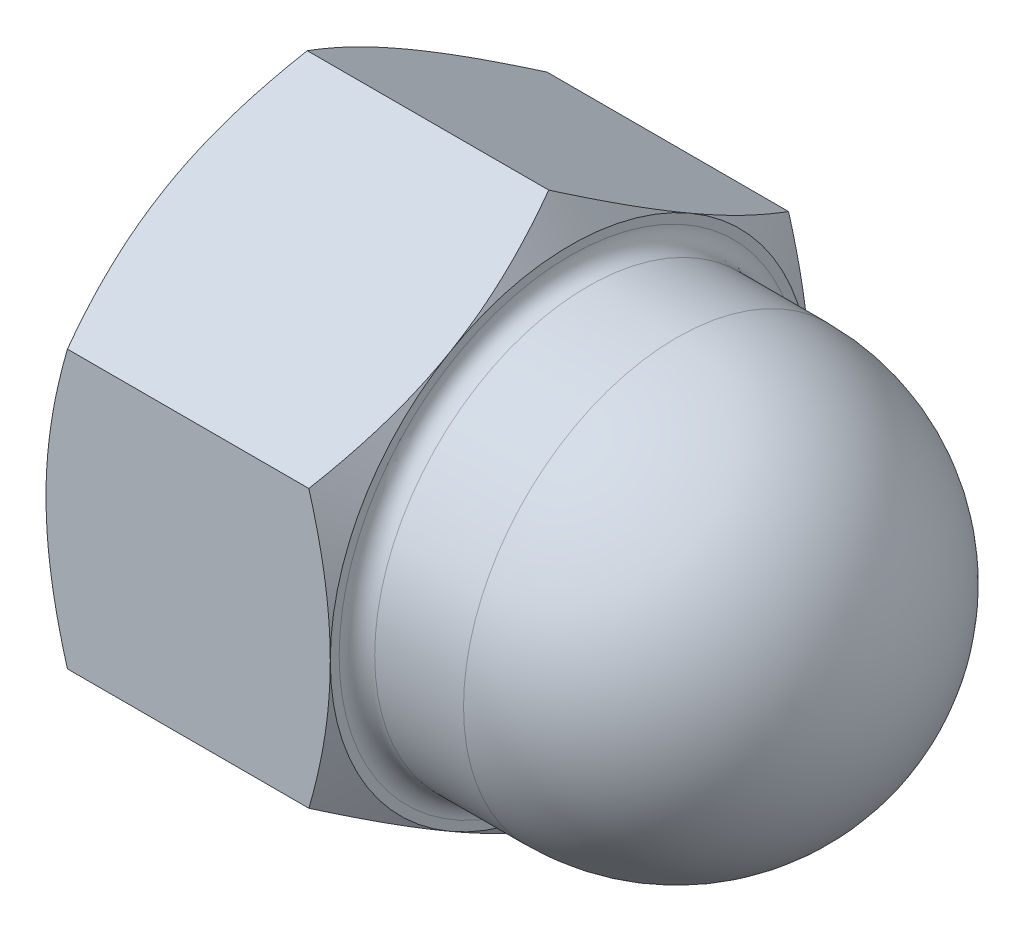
ISO-10303-21;
HEADER;
FILE_DESCRIPTION(('STEP AP214'),'2;1');
FILE_NAME('part.step','',(''),(''),'','','');
FILE_SCHEMA(('AUTOMOTIVE_DESIGN { 1 0 10303 214 1 1 1 1 }'));
ENDSEC;
DATA;
#1=APPLICATION_CONTEXT('core data for automotive mechanical design processes');
#2=APPLICATION_PROTOCOL_DEFINITION('international standard','automotive_design',2000,#1);
#3=PRODUCT_CONTEXT('',#1,'mechanical');
#4=PRODUCT('Part','Part','',(#3));
#5=PRODUCT_RELATED_PRODUCT_CATEGORY('part','',(#4));
#6=PRODUCT_DEFINITION_FORMATION('','',#4);
#7=PRODUCT_DEFINITION_CONTEXT('part definition',#1,'design');
#8=PRODUCT_DEFINITION('design','',#6,#7);
#9=PRODUCT_DEFINITION_SHAPE('','',#8);
#10=(LENGTH_UNIT() NAMED_UNIT(*) SI_UNIT(.MILLI.,.METRE.));
#11=(NAMED_UNIT(*) PLANE_ANGLE_UNIT() SI_UNIT($,.RADIAN.));
#12=(NAMED_UNIT(*) SI_UNIT($,.STERADIAN.) SOLID_ANGLE_UNIT());
#13=UNCERTAINTY_MEASURE_WITH_UNIT(LENGTH_MEASURE(1.E-05),#10,'distance_accuracy_value','');
#14=(GEOMETRIC_REPRESENTATION_CONTEXT(3) GLOBAL_UNCERTAINTY_ASSIGNED_CONTEXT((#13)) GLOBAL_UNIT_ASSIGNED_CONTEXT((#10,
#11,#12)) REPRESENTATION_CONTEXT('',''));
#15=CARTESIAN_POINT('',(0.,0.,0.));
#16=DIRECTION('',(0.,0.,1.));
#17=DIRECTION('',(1.,0.,0.));
#18=AXIS2_PLACEMENT_3D('',#15,#16,#17);
#19=CARTESIAN_POINT('',(16.,0.,27.));
#20=DIRECTION('',(1.,0.,0.));
#21=DIRECTION('',(0.,0.,-1.));
#22=AXIS2_PLACEMENT_3D('',#19,#20,#21);
#23=PLANE('',#22);
#24=CARTESIAN_POINT('',(16.,0.,0.));
#25=DIRECTION('',(1.,0.,0.));
#26=DIRECTION('',(0.,0.,-1.));
#27=AXIS2_PLACEMENT_3D('',#24,#25,#26);
#28=CIRCLE('',#27,13.);
#29=CARTESIAN_POINT('',(16.,0.,-13.));
#30=VERTEX_POINT('',#29);
#31=EDGE_CURVE('E43',#30,#30,#28,.F.);
#32=ORIENTED_EDGE('',*,*,#31,.T.);
#33=EDGE_LOOP('',(#32));
#34=FACE_BOUND('',#33,.T.);
#35=CARTESIAN_POINT('',(16.,0.,0.));
#36=DIRECTION('',(1.,0.,0.));
#37=DIRECTION('',(0.,0.,-1.));
#38=AXIS2_PLACEMENT_3D('',#35,#36,#37);
#39=CIRCLE('',#38,13.5);
#40=CARTESIAN_POINT('',(16.,-11.6913429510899,-6.74999999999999));
#41=VERTEX_POINT('',#40);
#42=CARTESIAN_POINT('',(16.,0.,-13.5));
#43=VERTEX_POINT('',#42);
#44=EDGE_CURVE('E325',#41,#43,#39,.T.);
#45=ORIENTED_EDGE('',*,*,#44,.T.);
#46=CARTESIAN_POINT('',(16.,11.6913429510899,-6.75000000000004));
#47=VERTEX_POINT('',#46);
#48=EDGE_CURVE('E50',#43,#47,#39,.T.);
#49=ORIENTED_EDGE('',*,*,#48,.T.);
#50=CARTESIAN_POINT('',(16.,11.6913429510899,6.74999999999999));
#51=VERTEX_POINT('',#50);
#52=EDGE_CURVE('E344',#47,#51,#39,.T.);
#53=ORIENTED_EDGE('',*,*,#52,.T.);
#54=CARTESIAN_POINT('',(16.,0.,0.));
#55=DIRECTION('',(-1.,0.,0.));
#56=DIRECTION('',(0.,0.,1.));
#57=AXIS2_PLACEMENT_3D('',#54,#55,#56);
#58=CIRCLE('',#57,13.5);
#59=CARTESIAN_POINT('',(16.,0.,13.5));
#60=VERTEX_POINT('',#59);
#61=EDGE_CURVE('E377',#60,#51,#58,.T.);
#62=ORIENTED_EDGE('',*,*,#61,.F.);
#63=CARTESIAN_POINT('',(16.,-11.6913429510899,6.75000000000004));
#64=VERTEX_POINT('',#63);
#65=EDGE_CURVE('E345',#60,#64,#39,.T.);
#66=ORIENTED_EDGE('',*,*,#65,.T.);
#67=EDGE_CURVE('E327',#64,#41,#39,.T.);
#68=ORIENTED_EDGE('',*,*,#67,.T.);
#69=EDGE_LOOP('',(#45,#49,#53,#62,#66,#68));
#70=FACE_BOUND('',#69,.T.);
#71=ADVANCED_FACE('F35',(#34,#70),#23,.T.);
#72=CARTESIAN_POINT('',(22.,0.,0.));
#73=DIRECTION('',(-1.,0.,0.));
#74=DIRECTION('',(0.,1.,0.));
#75=AXIS2_PLACEMENT_3D('',#72,#73,#74);
#76=SPHERICAL_SURFACE('',#75,12.);
#77=CARTESIAN_POINT('',(22.,0.,0.));
#78=DIRECTION('',(-1.,0.,0.));
#79=DIRECTION('',(0.,0.,1.));
#80=AXIS2_PLACEMENT_3D('',#77,#78,#79);
#81=CIRCLE('',#80,12.);
#82=CARTESIAN_POINT('',(22.,0.,12.));
#83=VERTEX_POINT('',#82);
#84=EDGE_CURVE('E302',#83,#83,#81,.T.);
#85=ORIENTED_EDGE('',*,*,#84,.F.);
#86=EDGE_LOOP('',(#85));
#87=FACE_BOUND('',#86,.T.);
#88=ADVANCED_FACE('F145',(#87),#76,.T.);
#89=CARTESIAN_POINT('',(0.,0.,0.));
#90=DIRECTION('',(-1.,0.,0.));
#91=DIRECTION('',(0.,0.,1.));
#92=AXIS2_PLACEMENT_3D('',#89,#90,#91);
#93=CYLINDRICAL_SURFACE('',#92,12.);
#94=CARTESIAN_POINT('',(17.,0.,0.));
#95=DIRECTION('',(1.,0.,0.));
#96=DIRECTION('',(0.,0.,-1.));
#97=AXIS2_PLACEMENT_3D('',#94,#95,#96);
#98=CIRCLE('',#97,12.);
#99=CARTESIAN_POINT('',(17.,0.,-12.));
#100=VERTEX_POINT('',#99);
#101=EDGE_CURVE('E11',#100,#100,#98,.T.);
#102=ORIENTED_EDGE('',*,*,#101,.T.);
#103=EDGE_LOOP('',(#102));
#104=FACE_BOUND('',#103,.T.);
#105=ORIENTED_EDGE('',*,*,#84,.T.);
#106=EDGE_LOOP('',(#105));
#107=FACE_BOUND('',#106,.T.);
#108=ADVANCED_FACE('F151',(#104,#107),#93,.T.);
#109=CARTESIAN_POINT('',(13.4951905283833,0.,0.));
#110=DIRECTION('',(-1.,0.,0.));
#111=DIRECTION('',(0.,0.,1.));
#112=AXIS2_PLACEMENT_3D('',#109,#110,#111);
#113=CONICAL_SURFACE('',#112,17.8384572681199,1.0471975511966);
#114=CARTESIAN_POINT('',(14.7941619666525,-15.5885727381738,0.000200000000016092));
#115=CARTESIAN_POINT('',(14.8930639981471,-15.417258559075,-0.296524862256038));
#116=CARTESIAN_POINT('',(14.9874780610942,-15.2452761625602,-0.594407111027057));
#117=CARTESIAN_POINT('',(15.1660827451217,-14.899932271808,-1.19256027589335));
#118=CARTESIAN_POINT('',(15.2502700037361,-14.7265703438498,-1.49283194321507));
#119=CARTESIAN_POINT('',(15.4072894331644,-14.3781323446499,-2.09634426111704));
#120=CARTESIAN_POINT('',(15.4800947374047,-14.2030532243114,-2.39959019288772));
#121=CARTESIAN_POINT('',(15.6127869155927,-13.8516783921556,-3.00818925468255));
#122=CARTESIAN_POINT('',(15.6726745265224,-13.675382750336,-3.31354226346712));
#123=CARTESIAN_POINT('',(15.7769840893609,-13.3260922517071,-3.91853115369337));
#124=CARTESIAN_POINT('',(15.8217512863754,-13.1531233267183,-4.21812211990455));
#125=CARTESIAN_POINT('',(15.8968160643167,-12.8063928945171,-4.81867684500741));
#126=CARTESIAN_POINT('',(15.927113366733,-12.632631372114,-5.11964063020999));
#127=CARTESIAN_POINT('',(15.9724733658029,-12.284816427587,-5.72207378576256));
#128=CARTESIAN_POINT('',(15.9875541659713,-12.1107635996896,-6.02354212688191));
#129=CARTESIAN_POINT('',(16.0021568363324,-11.7624972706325,-6.62675710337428));
#130=CARTESIAN_POINT('',(16.0016791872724,-11.5882837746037,-6.92850372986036));
#131=CARTESIAN_POINT('',(15.9862516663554,-11.262592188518,-7.49261810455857));
#132=CARTESIAN_POINT('',(15.9731835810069,-11.1110908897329,-7.75502605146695));
#133=CARTESIAN_POINT('',(15.9355274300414,-10.8084367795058,-8.27923834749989));
#134=CARTESIAN_POINT('',(15.910938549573,-10.6572839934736,-8.54104265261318));
#135=CARTESIAN_POINT('',(15.850669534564,-10.3554090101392,-9.06390546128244));
#136=CARTESIAN_POINT('',(15.8149802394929,-10.2046872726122,-9.32496316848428));
#137=CARTESIAN_POINT('',(15.7331365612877,-9.90395041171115,-9.84585469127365));
#138=CARTESIAN_POINT('',(15.6869814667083,-9.75393533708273,-10.1056884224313));
#139=CARTESIAN_POINT('',(15.5316507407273,-9.29855621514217,-10.8944281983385));
#140=CARTESIAN_POINT('',(15.4069869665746,-8.99451087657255,-11.4210501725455));
#141=CARTESIAN_POINT('',(15.124051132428,-8.39095390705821,-12.4664415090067));
#142=CARTESIAN_POINT('',(14.9658455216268,-8.09143454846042,-12.9852242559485));
#143=CARTESIAN_POINT('',(14.7941619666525,-7.79411316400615,-13.5002));
#144=B_SPLINE_CURVE_WITH_KNOTS('',3,(#114,#115,#116,#117,#118,#119,#120,#121,#122,#123,#124,
#125,#126,#127,#128,#129,#130,#131,#132,#133,#134,#135,#136,#137,#138,#139,#140,#141,#142,#143),
.UNSPECIFIED.,.F.,.F.,(4,2,2,2,2,2,2,2,2,2,2,2,2,2,4),(0.,1.0698794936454,2.14010980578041,
3.21282939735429,4.28548777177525,5.33167033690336,6.37787303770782,7.42282956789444,
8.46775380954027,9.377387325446,10.2870851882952,11.1975357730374,12.1080482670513,
13.9691139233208,15.8265265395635),.UNSPECIFIED.);
#145=CARTESIAN_POINT('',(14.79422863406,-7.79422863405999,-13.5));
#146=VERTEX_POINT('',#145);
#147=EDGE_CURVE('E222',#41,#146,#144,.T.);
#148=ORIENTED_EDGE('',*,*,#147,.T.);
#149=CARTESIAN_POINT('',(9.45241496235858,-20.8521667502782,-13.5));
#150=CARTESIAN_POINT('',(9.59511737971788,-20.557714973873,-13.5));
#151=CARTESIAN_POINT('',(9.73710179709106,-20.2629153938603,-13.5));
#152=CARTESIAN_POINT('',(10.0194718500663,-19.6725480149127,-13.5));
#153=CARTESIAN_POINT('',(10.1598574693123,-19.3769802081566,-13.5));
#154=CARTESIAN_POINT('',(10.5784094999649,-18.4889356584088,-13.5));
#155=CARTESIAN_POINT('',(10.8539281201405,-17.8952061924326,-13.5));
#156=CARTESIAN_POINT('',(11.3977239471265,-16.7004741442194,-13.5));
#157=CARTESIAN_POINT('',(11.6659528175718,-16.0994495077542,-13.5));
#158=CARTESIAN_POINT('',(12.1913253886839,-14.8925910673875,-13.5));
#159=CARTESIAN_POINT('',(12.4484696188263,-14.286757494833,-13.5));
#160=CARTESIAN_POINT('',(12.9566456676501,-13.0500707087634,-13.5));
#161=CARTESIAN_POINT('',(13.2072277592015,-12.4190317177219,-13.5));
#162=CARTESIAN_POINT('',(13.6892233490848,-11.149535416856,-13.5));
#163=CARTESIAN_POINT('',(13.9206346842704,-10.5110772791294,-13.5));
#164=CARTESIAN_POINT('',(14.3581485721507,-9.22697055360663,-13.5));
#165=CARTESIAN_POINT('',(14.5643030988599,-8.58133981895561,-13.5));
#166=CARTESIAN_POINT('',(14.944643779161,-7.28075613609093,-13.5));
#167=CARTESIAN_POINT('',(15.1188400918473,-6.62580622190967,-13.5));
#168=CARTESIAN_POINT('',(15.3493451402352,-5.63809606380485,-13.5));
#169=CARTESIAN_POINT('',(15.4208971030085,-5.30887099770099,-13.5));
#170=CARTESIAN_POINT('',(15.5528778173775,-4.64818722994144,-13.5));
#171=CARTESIAN_POINT('',(15.6133068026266,-4.31672857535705,-13.5));
#172=CARTESIAN_POINT('',(15.7219699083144,-3.65181174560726,-13.5));
#173=CARTESIAN_POINT('',(15.7702041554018,-3.31835359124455,-13.5));
#174=CARTESIAN_POINT('',(15.8535123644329,-2.6497986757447,-13.5));
#175=CARTESIAN_POINT('',(15.8885868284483,-2.31470197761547,-13.5));
#176=CARTESIAN_POINT('',(15.9444436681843,-1.64767572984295,-13.5));
#177=CARTESIAN_POINT('',(15.9654049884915,-1.31576125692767,-13.5));
#178=CARTESIAN_POINT('',(15.9932782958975,-0.651344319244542,-13.5));
#179=CARTESIAN_POINT('',(16.0001905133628,-0.318841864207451,-13.5));
#180=CARTESIAN_POINT('',(15.999801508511,0.346158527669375,-13.5));
#181=CARTESIAN_POINT('',(15.9925001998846,0.678656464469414,-13.5));
#182=CARTESIAN_POINT('',(15.9638607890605,1.343051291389,-13.5));
#183=CARTESIAN_POINT('',(15.9425220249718,1.67494815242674,-13.5));
#184=CARTESIAN_POINT('',(15.8745985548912,2.47518097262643,-13.5));
#185=CARTESIAN_POINT('',(15.8212102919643,2.9429494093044,-13.5));
#186=CARTESIAN_POINT('',(15.6894785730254,3.87496160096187,-13.5));
#187=CARTESIAN_POINT('',(15.6111316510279,4.33920485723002,-13.5));
#188=CARTESIAN_POINT('',(15.4322698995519,5.26374293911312,-13.5));
#189=CARTESIAN_POINT('',(15.3317374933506,5.72403433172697,-13.5));
#190=CARTESIAN_POINT('',(15.1115679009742,6.63997385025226,-13.5));
#191=CARTESIAN_POINT('',(14.9919310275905,7.09562205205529,-13.5));
#192=CARTESIAN_POINT('',(14.7336550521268,8.01220961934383,-13.5));
#193=CARTESIAN_POINT('',(14.5946582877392,8.47304750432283,-13.5));
#194=CARTESIAN_POINT('',(14.302490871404,9.39018278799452,-13.5));
#195=CARTESIAN_POINT('',(14.1493201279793,9.84648015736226,-13.5));
#196=CARTESIAN_POINT('',(13.8312202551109,10.7547628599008,-13.5));
#197=CARTESIAN_POINT('',(13.6662951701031,11.2067496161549,-13.5));
#198=CARTESIAN_POINT('',(13.3266084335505,12.1069908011,-13.5));
#199=CARTESIAN_POINT('',(13.1518468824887,12.5552452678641,-13.5));
#200=CARTESIAN_POINT('',(12.737707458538,13.5893059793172,-13.5));
#201=CARTESIAN_POINT('',(12.495332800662,14.17391000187,-13.5));
#202=CARTESIAN_POINT('',(11.9993131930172,15.3383308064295,-13.5));
#203=CARTESIAN_POINT('',(11.7456676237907,15.9181473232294,-13.5));
#204=CARTESIAN_POINT('',(11.2292969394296,17.0738527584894,-13.5));
#205=CARTESIAN_POINT('',(10.9665700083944,17.6497408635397,-13.5));
#206=CARTESIAN_POINT('',(10.4338131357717,18.7981078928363,-13.5));
#207=CARTESIAN_POINT('',(10.1637833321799,19.3705868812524,-13.5));
#208=CARTESIAN_POINT('',(9.61747183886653,20.5132628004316,-13.5));
#209=CARTESIAN_POINT('',(9.34118408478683,21.0834568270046,-13.5));
#210=CARTESIAN_POINT('',(8.78366530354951,22.2214224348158,-13.5));
#211=CARTESIAN_POINT('',(8.50243425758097,22.7891940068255,-13.5));
#212=CARTESIAN_POINT('',(7.93588795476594,23.9226111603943,-13.5));
#213=CARTESIAN_POINT('',(7.65057317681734,24.4882569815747,-13.5));
#214=CARTESIAN_POINT('',(7.07647909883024,25.6177887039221,-13.5));
#215=CARTESIAN_POINT('',(6.78769978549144,26.1816745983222,-13.5));
#216=CARTESIAN_POINT('',(5.96367081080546,27.7804770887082,-13.5));
#217=CARTESIAN_POINT('',(5.42493945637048,28.8135992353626,-13.5));
#218=CARTESIAN_POINT('',(4.34004841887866,30.8759686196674,-13.5));
#219=CARTESIAN_POINT('',(3.79388849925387,31.9052157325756,-13.5));
#220=CARTESIAN_POINT('',(2.69713668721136,33.9582549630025,-13.5));
#221=CARTESIAN_POINT('',(2.1465581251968,34.9820542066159,-13.5));
#222=CARTESIAN_POINT('',(1.31735292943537,36.5159127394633,-13.5));
#223=CARTESIAN_POINT('',(1.04040202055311,37.0268792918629,-13.5));
#224=CARTESIAN_POINT('',(0.485497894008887,38.0482668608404,-13.5));
#225=CARTESIAN_POINT('',(0.207544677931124,38.5586878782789,-13.5));
#226=CARTESIAN_POINT('',(-0.0708527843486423,39.0688665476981,-13.5));
#227=B_SPLINE_CURVE_WITH_KNOTS('',3,(#149,#150,#151,#152,#153,#154,#155,#156,#157,#158,#159,
#160,#161,#162,#163,#164,#165,#166,#167,#168,#169,#170,#171,#172,#173,#174,#175,#176,#177,#178,
#179,#180,#181,#182,#183,#184,#185,#186,#187,#188,#189,#190,#191,#192,#193,#194,#195,#196,#197,
#198,#199,#200,#201,#202,#203,#204,#205,#206,#207,#208,#209,#210,#211,#212,#213,#214,#215,#216,
#217,#218,#219,#220,#221,#222,#223,#224,#225,#226),.UNSPECIFIED.,.F.,.F.,(4,2,2,2,2,2,2,2,2,2,2,
2,2,2,2,2,2,2,2,2,2,2,2,2,2,2,2,2,2,2,2,2,2,2,2,2,2,2,4),(0.,0.981625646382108,1.96326132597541,
3.92682754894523,5.90122666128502,7.87553135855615,9.91220651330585,11.9491111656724,
13.9817511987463,16.0137439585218,17.0243185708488,18.034871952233,19.0454148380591,
20.0559191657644,21.0533567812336,22.0507780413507,23.0482053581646,24.0456797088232,
25.4573125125,26.8691414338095,28.2820929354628,29.6950213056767,31.1387791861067,
32.5825463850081,34.0258191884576,35.4690772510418,37.367488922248,39.2660050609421,
41.1649030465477,43.0637651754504,44.964553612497,46.8653492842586,48.765923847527,
50.666505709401,54.1619080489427,57.6574219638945,61.1447718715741,62.8883586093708,
64.6319425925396),.UNSPECIFIED.);
#228=EDGE_CURVE('E294',#43,#146,#227,.F.);
#229=ORIENTED_EDGE('',*,*,#228,.F.);
#230=ORIENTED_EDGE('',*,*,#44,.F.);
#231=EDGE_LOOP('',(#148,#229,#230));
#232=FACE_BOUND('',#231,.T.);
#233=ADVANCED_FACE('F509',(#232),#113,.T.);
#234=CARTESIAN_POINT('',(14.7941619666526,-7.7941131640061,13.5002));
#235=CARTESIAN_POINT('',(14.8930639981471,-7.96542734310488,13.2034751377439));
#236=CARTESIAN_POINT('',(14.9874780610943,-8.13740973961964,12.9055928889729));
#237=CARTESIAN_POINT('',(15.1660827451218,-8.48275363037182,12.3074397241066));
#238=CARTESIAN_POINT('',(15.2502700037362,-8.65611555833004,12.0071680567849));
#239=CARTESIAN_POINT('',(15.4072894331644,-9.00455355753,11.403655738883));
#240=CARTESIAN_POINT('',(15.4800947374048,-9.17963267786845,11.1004098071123));
#241=CARTESIAN_POINT('',(15.6127869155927,-9.53100751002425,10.4918107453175));
#242=CARTESIAN_POINT('',(15.6726745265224,-9.70730315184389,10.1864577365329));
#243=CARTESIAN_POINT('',(15.7769840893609,-10.0565936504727,9.58146884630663));
#244=CARTESIAN_POINT('',(15.8217512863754,-10.2295625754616,9.28187788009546));
#245=CARTESIAN_POINT('',(15.8968160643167,-10.5762930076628,8.6813231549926));
#246=CARTESIAN_POINT('',(15.927113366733,-10.7500545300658,8.38035936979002));
#247=CARTESIAN_POINT('',(15.9724733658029,-11.0978694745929,7.77792621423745));
#248=CARTESIAN_POINT('',(15.9875541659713,-11.2719223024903,7.47645787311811));
#249=CARTESIAN_POINT('',(16.0021568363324,-11.6201886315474,6.87324289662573));
#250=CARTESIAN_POINT('',(16.0016791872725,-11.7944021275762,6.57149627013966));
#251=CARTESIAN_POINT('',(15.9862516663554,-12.1200937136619,6.00738189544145));
#252=CARTESIAN_POINT('',(15.973183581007,-12.271595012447,5.74497394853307));
#253=CARTESIAN_POINT('',(15.9355274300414,-12.5742491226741,5.22076165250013));
#254=CARTESIAN_POINT('',(15.910938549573,-12.7254019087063,4.95895734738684));
#255=CARTESIAN_POINT('',(15.850669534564,-13.0272768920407,4.43609453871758));
#256=CARTESIAN_POINT('',(15.8149802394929,-13.1779986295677,4.17503683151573));
#257=CARTESIAN_POINT('',(15.7331365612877,-13.4787354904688,3.65414530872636));
#258=CARTESIAN_POINT('',(15.6869814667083,-13.6287505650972,3.39431157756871));
#259=CARTESIAN_POINT('',(15.5316507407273,-14.0841296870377,2.60557180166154));
#260=CARTESIAN_POINT('',(15.4069869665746,-14.3881750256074,2.07894982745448));
#261=CARTESIAN_POINT('',(15.124051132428,-14.9917319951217,1.03355849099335));
#262=CARTESIAN_POINT('',(14.9658455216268,-15.2912513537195,0.514775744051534));
#263=CARTESIAN_POINT('',(14.7941619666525,-15.5885727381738,-0.000199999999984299));
#264=B_SPLINE_CURVE_WITH_KNOTS('',3,(#234,#235,#236,#237,#238,#239,#240,#241,#242,#243,#244,
#245,#246,#247,#248,#249,#250,#251,#252,#253,#254,#255,#256,#257,#258,#259,#260,#261,#262,#263),
.UNSPECIFIED.,.F.,.F.,(4,2,2,2,2,2,2,2,2,2,2,2,2,2,4),(0.,1.0698794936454,2.14010980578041,
3.21282939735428,4.28548777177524,5.33167033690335,6.3778730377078,7.42282956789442,
8.46775380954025,9.37738732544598,10.2870851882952,11.1975357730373,12.1080482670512,
13.9691139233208,15.8265265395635),.UNSPECIFIED.);
#265=CARTESIAN_POINT('',(14.7942286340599,-15.5884572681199,0.));
#266=VERTEX_POINT('',#265);
#267=EDGE_CURVE('E228',#64,#266,#264,.T.);
#268=ORIENTED_EDGE('',*,*,#267,.T.);
#269=EDGE_CURVE('E235',#266,#41,#144,.T.);
#270=ORIENTED_EDGE('',*,*,#269,.T.);
#271=ORIENTED_EDGE('',*,*,#67,.F.);
#272=EDGE_LOOP('',(#268,#270,#271));
#273=FACE_BOUND('',#272,.T.);
#274=ADVANCED_FACE('F524',(#273),#113,.T.);
#275=CARTESIAN_POINT('',(9.45241496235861,-20.8521667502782,13.5));
#276=CARTESIAN_POINT('',(9.59511737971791,-20.5577149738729,13.5));
#277=CARTESIAN_POINT('',(9.73710179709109,-20.2629153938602,13.5));
#278=CARTESIAN_POINT('',(10.0194718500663,-19.6725480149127,13.5));
#279=CARTESIAN_POINT('',(10.1598574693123,-19.3769802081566,13.5));
#280=CARTESIAN_POINT('',(10.5784094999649,-18.4889356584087,13.5));
#281=CARTESIAN_POINT('',(10.8539281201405,-17.8952061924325,13.5));
#282=CARTESIAN_POINT('',(11.3977239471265,-16.7004741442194,13.5));
#283=CARTESIAN_POINT('',(11.6659528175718,-16.0994495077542,13.5));
#284=CARTESIAN_POINT('',(12.191325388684,-14.8925910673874,13.5));
#285=CARTESIAN_POINT('',(12.4484696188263,-14.286757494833,13.5));
#286=CARTESIAN_POINT('',(12.9566456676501,-13.0500707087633,13.5));
#287=CARTESIAN_POINT('',(13.2072277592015,-12.4190317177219,13.5));
#288=CARTESIAN_POINT('',(13.6892233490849,-11.1495354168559,13.5));
#289=CARTESIAN_POINT('',(13.9206346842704,-10.5110772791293,13.5));
#290=CARTESIAN_POINT('',(14.3581485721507,-9.22697055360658,13.5));
#291=CARTESIAN_POINT('',(14.56430309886,-8.58133981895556,13.5));
#292=CARTESIAN_POINT('',(14.944643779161,-7.28075613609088,13.5));
#293=CARTESIAN_POINT('',(15.1188400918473,-6.62580622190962,13.5));
#294=CARTESIAN_POINT('',(15.3493451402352,-5.6380960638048,13.5));
#295=CARTESIAN_POINT('',(15.4208971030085,-5.30887099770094,13.5));
#296=CARTESIAN_POINT('',(15.5528778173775,-4.6481872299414,13.5));
#297=CARTESIAN_POINT('',(15.6133068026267,-4.316728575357,13.5));
#298=CARTESIAN_POINT('',(15.7219699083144,-3.65181174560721,13.5));
#299=CARTESIAN_POINT('',(15.7702041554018,-3.3183535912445,13.5));
#300=CARTESIAN_POINT('',(15.8535123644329,-2.64979867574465,13.5));
#301=CARTESIAN_POINT('',(15.8885868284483,-2.31470197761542,13.5));
#302=CARTESIAN_POINT('',(15.9444436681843,-1.6476757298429,13.5));
#303=CARTESIAN_POINT('',(15.9654049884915,-1.31576125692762,13.5));
#304=CARTESIAN_POINT('',(15.9932782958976,-0.651344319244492,13.5));
#305=CARTESIAN_POINT('',(16.0001905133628,-0.318841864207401,13.5));
#306=CARTESIAN_POINT('',(15.999801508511,0.346158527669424,13.5));
#307=CARTESIAN_POINT('',(15.9925001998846,0.678656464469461,13.5));
#308=CARTESIAN_POINT('',(15.9638607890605,1.34305129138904,13.5));
#309=CARTESIAN_POINT('',(15.9425220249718,1.67494815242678,13.5));
#310=CARTESIAN_POINT('',(15.8745985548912,2.47518097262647,13.5));
#311=CARTESIAN_POINT('',(15.8212102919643,2.94294940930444,13.5));
#312=CARTESIAN_POINT('',(15.6894785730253,3.87496160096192,13.5));
#313=CARTESIAN_POINT('',(15.6111316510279,4.33920485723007,13.5));
#314=CARTESIAN_POINT('',(15.4322698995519,5.26374293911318,13.5));
#315=CARTESIAN_POINT('',(15.3317374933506,5.72403433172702,13.5));
#316=CARTESIAN_POINT('',(15.1115679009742,6.63997385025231,13.5));
#317=CARTESIAN_POINT('',(14.9919310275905,7.09562205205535,13.5));
#318=CARTESIAN_POINT('',(14.7336550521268,8.01220961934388,13.5));
#319=CARTESIAN_POINT('',(14.5946582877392,8.47304750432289,13.5));
#320=CARTESIAN_POINT('',(14.302490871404,9.39018278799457,13.5));
#321=CARTESIAN_POINT('',(14.1493201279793,9.84648015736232,13.5));
#322=CARTESIAN_POINT('',(13.8312202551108,10.7547628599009,13.5));
#323=CARTESIAN_POINT('',(13.6662951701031,11.2067496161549,13.5));
#324=CARTESIAN_POINT('',(13.3266084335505,12.1069908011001,13.5));
#325=CARTESIAN_POINT('',(13.1518468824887,12.5552452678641,13.5));
#326=CARTESIAN_POINT('',(12.7377074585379,13.5893059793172,13.5));
#327=CARTESIAN_POINT('',(12.495332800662,14.17391000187,13.5));
#328=CARTESIAN_POINT('',(11.9993131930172,15.3383308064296,13.5));
#329=CARTESIAN_POINT('',(11.7456676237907,15.9181473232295,13.5));
#330=CARTESIAN_POINT('',(11.2292969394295,17.0738527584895,13.5));
#331=CARTESIAN_POINT('',(10.9665700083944,17.6497408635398,13.5));
#332=CARTESIAN_POINT('',(10.4338131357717,18.7981078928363,13.5));
#333=CARTESIAN_POINT('',(10.1637833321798,19.3705868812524,13.5));
#334=CARTESIAN_POINT('',(9.6174718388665,20.5132628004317,13.5));
#335=CARTESIAN_POINT('',(9.3411840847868,21.0834568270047,13.5));
#336=CARTESIAN_POINT('',(8.78366530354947,22.2214224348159,13.5));
#337=CARTESIAN_POINT('',(8.50243425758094,22.7891940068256,13.5));
#338=CARTESIAN_POINT('',(7.93588795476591,23.9226111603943,13.5));
#339=CARTESIAN_POINT('',(7.65057317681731,24.4882569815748,13.5));
#340=CARTESIAN_POINT('',(7.0764790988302,25.6177887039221,13.5));
#341=CARTESIAN_POINT('',(6.78769978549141,26.1816745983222,13.5));
#342=CARTESIAN_POINT('',(5.96367081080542,27.7804770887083,13.5));
#343=CARTESIAN_POINT('',(5.42493945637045,28.8135992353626,13.5));
#344=CARTESIAN_POINT('',(4.34004841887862,30.8759686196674,13.5));
#345=CARTESIAN_POINT('',(3.79388849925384,31.9052157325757,13.5));
#346=CARTESIAN_POINT('',(2.69713668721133,33.9582549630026,13.5));
#347=CARTESIAN_POINT('',(2.14655812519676,34.982054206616,13.5));
#348=CARTESIAN_POINT('',(1.31735292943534,36.5159127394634,13.5));
#349=CARTESIAN_POINT('',(1.04040202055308,37.026879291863,13.5));
#350=CARTESIAN_POINT('',(0.485497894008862,38.0482668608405,13.5));
#351=CARTESIAN_POINT('',(0.207544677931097,38.558687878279,13.5));
#352=CARTESIAN_POINT('',(-0.0708527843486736,39.0688665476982,13.5));
#353=B_SPLINE_CURVE_WITH_KNOTS('',3,(#275,#276,#277,#278,#279,#280,#281,#282,#283,#284,#285,
#286,#287,#288,#289,#290,#291,#292,#293,#294,#295,#296,#297,#298,#299,#300,#301,#302,#303,#304,
#305,#306,#307,#308,#309,#310,#311,#312,#313,#314,#315,#316,#317,#318,#319,#320,#321,#322,#323,
#324,#325,#326,#327,#328,#329,#330,#331,#332,#333,#334,#335,#336,#337,#338,#339,#340,#341,#342,
#343,#344,#345,#346,#347,#348,#349,#350,#351,#352),.UNSPECIFIED.,.F.,.F.,(4,2,2,2,2,2,2,2,2,2,2,
2,2,2,2,2,2,2,2,2,2,2,2,2,2,2,2,2,2,2,2,2,2,2,2,2,2,2,4),(0.,0.981625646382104,1.96326132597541,
3.92682754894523,5.90122666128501,7.87553135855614,9.91220651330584,11.9491111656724,
13.9817511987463,16.0137439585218,17.0243185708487,18.034871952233,19.045414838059,
20.0559191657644,21.0533567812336,22.0507780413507,23.0482053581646,24.0456797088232,
25.4573125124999,26.8691414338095,28.2820929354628,29.6950213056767,31.1387791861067,
32.5825463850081,34.0258191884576,35.4690772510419,37.367488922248,39.2660050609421,
41.1649030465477,43.0637651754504,44.964553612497,46.8653492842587,48.765923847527,
50.666505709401,54.1619080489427,57.6574219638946,61.1447718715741,62.8883586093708,
64.6319425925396),.UNSPECIFIED.);
#354=CARTESIAN_POINT('',(14.79422863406,-7.79422863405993,13.5));
#355=VERTEX_POINT('',#354);
#356=EDGE_CURVE('E236',#60,#355,#353,.F.);
#357=ORIENTED_EDGE('',*,*,#356,.T.);
#358=EDGE_CURVE('E234',#355,#64,#264,.T.);
#359=ORIENTED_EDGE('',*,*,#358,.T.);
#360=ORIENTED_EDGE('',*,*,#65,.F.);
#361=EDGE_LOOP('',(#357,#359,#360));
#362=FACE_BOUND('',#361,.T.);
#363=ADVANCED_FACE('F422',(#362),#113,.T.);
#364=CARTESIAN_POINT('',(14.7941619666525,15.5885727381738,-0.000200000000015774));
#365=CARTESIAN_POINT('',(14.8930639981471,15.417258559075,0.296524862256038));
#366=CARTESIAN_POINT('',(14.9874780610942,15.2452761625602,0.594407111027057));
#367=CARTESIAN_POINT('',(15.1660827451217,14.899932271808,1.19256027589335));
#368=CARTESIAN_POINT('',(15.2502700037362,14.7265703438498,1.49283194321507));
#369=CARTESIAN_POINT('',(15.4072894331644,14.3781323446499,2.09634426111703));
#370=CARTESIAN_POINT('',(15.4800947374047,14.2030532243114,2.39959019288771));
#371=CARTESIAN_POINT('',(15.6127869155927,13.8516783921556,3.00818925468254));
#372=CARTESIAN_POINT('',(15.6726745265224,13.675382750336,3.31354226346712));
#373=CARTESIAN_POINT('',(15.7769840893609,13.3260922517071,3.91853115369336));
#374=CARTESIAN_POINT('',(15.8217512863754,13.1531233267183,4.21812211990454));
#375=CARTESIAN_POINT('',(15.8968160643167,12.8063928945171,4.8186768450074));
#376=CARTESIAN_POINT('',(15.927113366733,12.632631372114,5.11964063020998));
#377=CARTESIAN_POINT('',(15.9724733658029,12.284816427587,5.72207378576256));
#378=CARTESIAN_POINT('',(15.9875541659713,12.1107635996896,6.0235421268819));
#379=CARTESIAN_POINT('',(16.0021568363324,11.7624972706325,6.62675710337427));
#380=CARTESIAN_POINT('',(16.0016791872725,11.5882837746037,6.92850372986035));
#381=CARTESIAN_POINT('',(15.9862516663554,11.262592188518,7.49261810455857));
#382=CARTESIAN_POINT('',(15.973183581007,11.1110908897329,7.75502605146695));
#383=CARTESIAN_POINT('',(15.9355274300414,10.8084367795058,8.27923834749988));
#384=CARTESIAN_POINT('',(15.910938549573,10.6572839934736,8.54104265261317));
#385=CARTESIAN_POINT('',(15.850669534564,10.3554090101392,9.06390546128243));
#386=CARTESIAN_POINT('',(15.8149802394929,10.2046872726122,9.32496316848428));
#387=CARTESIAN_POINT('',(15.7331365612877,9.90395041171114,9.84585469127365));
#388=CARTESIAN_POINT('',(15.6869814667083,9.75393533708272,10.1056884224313));
#389=CARTESIAN_POINT('',(15.5316507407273,9.29855621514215,10.8944281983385));
#390=CARTESIAN_POINT('',(15.4069869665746,8.99451087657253,11.4210501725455));
#391=CARTESIAN_POINT('',(15.124051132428,8.3909539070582,12.4664415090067));
#392=CARTESIAN_POINT('',(14.9658455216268,8.09143454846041,12.9852242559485));
#393=CARTESIAN_POINT('',(14.7941619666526,7.79411316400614,13.5002));
#394=B_SPLINE_CURVE_WITH_KNOTS('',3,(#364,#365,#366,#367,#368,#369,#370,#371,#372,#373,#374,
#375,#376,#377,#378,#379,#380,#381,#382,#383,#384,#385,#386,#387,#388,#389,#390,#391,#392,#393),
.UNSPECIFIED.,.F.,.F.,(4,2,2,2,2,2,2,2,2,2,2,2,2,2,4),(0.,1.0698794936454,2.14010980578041,
3.21282939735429,4.28548777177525,5.33167033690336,6.37787303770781,7.42282956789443,
8.46775380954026,9.37738732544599,10.2870851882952,11.1975357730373,12.1080482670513,
13.9691139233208,15.8265265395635),.UNSPECIFIED.);
#395=CARTESIAN_POINT('',(14.79422863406,7.79422863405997,13.5));
#396=VERTEX_POINT('',#395);
#397=EDGE_CURVE('E291',#51,#396,#394,.T.);
#398=ORIENTED_EDGE('',*,*,#397,.T.);
#399=EDGE_CURVE('E418',#396,#60,#353,.F.);
#400=ORIENTED_EDGE('',*,*,#399,.T.);
#401=ORIENTED_EDGE('',*,*,#61,.T.);
#402=EDGE_LOOP('',(#398,#400,#401));
#403=FACE_BOUND('',#402,.T.);
#404=ADVANCED_FACE('F208',(#403),#113,.T.);
#405=CARTESIAN_POINT('',(14.79422863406,15.5884572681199,0.));
#406=VERTEX_POINT('',#405);
#407=EDGE_CURVE('E216',#406,#51,#394,.T.);
#408=ORIENTED_EDGE('',*,*,#407,.T.);
#409=ORIENTED_EDGE('',*,*,#52,.F.);
#410=CARTESIAN_POINT('',(14.7941619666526,7.79411316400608,-13.5002));
#411=CARTESIAN_POINT('',(14.8930639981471,7.96542734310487,-13.2034751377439));
#412=CARTESIAN_POINT('',(14.9874780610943,8.13740973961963,-12.9055928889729));
#413=CARTESIAN_POINT('',(15.1660827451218,8.48275363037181,-12.3074397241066));
#414=CARTESIAN_POINT('',(15.2502700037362,8.65611555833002,-12.0071680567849));
#415=CARTESIAN_POINT('',(15.4072894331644,9.00455355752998,-11.403655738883));
#416=CARTESIAN_POINT('',(15.4800947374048,9.17963267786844,-11.1004098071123));
#417=CARTESIAN_POINT('',(15.6127869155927,9.53100751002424,-10.4918107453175));
#418=CARTESIAN_POINT('',(15.6726745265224,9.70730315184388,-10.1864577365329));
#419=CARTESIAN_POINT('',(15.7769840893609,10.0565936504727,-9.58146884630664));
#420=CARTESIAN_POINT('',(15.8217512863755,10.2295625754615,-9.28187788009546));
#421=CARTESIAN_POINT('',(15.8968160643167,10.5762930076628,-8.6813231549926));
#422=CARTESIAN_POINT('',(15.927113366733,10.7500545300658,-8.38035936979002));
#423=CARTESIAN_POINT('',(15.9724733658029,11.0978694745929,-7.77792621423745));
#424=CARTESIAN_POINT('',(15.9875541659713,11.2719223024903,-7.47645787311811));
#425=CARTESIAN_POINT('',(16.0021568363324,11.6201886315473,-6.87324289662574));
#426=CARTESIAN_POINT('',(16.0016791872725,11.7944021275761,-6.57149627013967));
#427=CARTESIAN_POINT('',(15.9862516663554,12.1200937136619,-6.00738189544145));
#428=CARTESIAN_POINT('',(15.973183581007,12.2715950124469,-5.74497394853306));
#429=CARTESIAN_POINT('',(15.9355274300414,12.5742491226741,-5.22076165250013));
#430=CARTESIAN_POINT('',(15.910938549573,12.7254019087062,-4.95895734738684));
#431=CARTESIAN_POINT('',(15.850669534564,13.0272768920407,-4.43609453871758));
#432=CARTESIAN_POINT('',(15.8149802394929,13.1779986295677,-4.17503683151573));
#433=CARTESIAN_POINT('',(15.7331365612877,13.4787354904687,-3.65414530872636));
#434=CARTESIAN_POINT('',(15.6869814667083,13.6287505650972,-3.39431157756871));
#435=CARTESIAN_POINT('',(15.5316507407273,14.0841296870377,-2.60557180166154));
#436=CARTESIAN_POINT('',(15.4069869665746,14.3881750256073,-2.07894982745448));
#437=CARTESIAN_POINT('',(15.124051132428,14.9917319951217,-1.03355849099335));
#438=CARTESIAN_POINT('',(14.9658455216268,15.2912513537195,-0.514775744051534));
#439=CARTESIAN_POINT('',(14.7941619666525,15.5885727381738,0.000199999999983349));
#440=B_SPLINE_CURVE_WITH_KNOTS('',3,(#410,#411,#412,#413,#414,#415,#416,#417,#418,#419,#420,
#421,#422,#423,#424,#425,#426,#427,#428,#429,#430,#431,#432,#433,#434,#435,#436,#437,#438,#439),
.UNSPECIFIED.,.F.,.F.,(4,2,2,2,2,2,2,2,2,2,2,2,2,2,4),(0.,1.0698794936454,2.1401098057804,
3.21282939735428,4.28548777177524,5.33167033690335,6.3778730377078,7.42282956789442,
8.46775380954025,9.37738732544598,10.2870851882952,11.1975357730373,12.1080482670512,
13.9691139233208,15.8265265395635),.UNSPECIFIED.);
#441=EDGE_CURVE('E182',#47,#406,#440,.T.);
#442=ORIENTED_EDGE('',*,*,#441,.T.);
#443=EDGE_LOOP('',(#408,#409,#442));
#444=FACE_BOUND('',#443,.T.);
#445=ADVANCED_FACE('F207',(#444),#113,.T.);
#446=CARTESIAN_POINT('',(14.79422863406,7.79422863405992,-13.5));
#447=VERTEX_POINT('',#446);
#448=EDGE_CURVE('E190',#447,#47,#440,.T.);
#449=ORIENTED_EDGE('',*,*,#448,.T.);
#450=ORIENTED_EDGE('',*,*,#48,.F.);
#451=EDGE_CURVE('E199',#447,#43,#227,.F.);
#452=ORIENTED_EDGE('',*,*,#451,.F.);
#453=EDGE_LOOP('',(#449,#450,#452));
#454=FACE_BOUND('',#453,.T.);
#455=ADVANCED_FACE('F167',(#454),#113,.T.);
#456=CARTESIAN_POINT('',(16.,7.79422863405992,-13.5));
#457=DIRECTION('',(0.,-0.866025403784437,0.500000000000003));
#458=DIRECTION('',(0.,-0.500000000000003,-0.866025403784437));
#459=AXIS2_PLACEMENT_3D('',#456,#457,#458);
#460=PLANE('',#459);
#461=ORIENTED_EDGE('',*,*,#448,.F.);
#462=DIRECTION('',(-1.,0.,0.));
#463=VECTOR('',#462,1.);
#464=CARTESIAN_POINT('',(16.,7.79422863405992,-13.5));
#465=LINE('',#464,#463);
#466=CARTESIAN_POINT('',(1.20577136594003,7.79422863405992,-13.5));
#467=VERTEX_POINT('',#466);
#468=EDGE_CURVE('E301',#447,#467,#465,.T.);
#469=ORIENTED_EDGE('',*,*,#468,.T.);
#470=CARTESIAN_POINT('',(1.20583803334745,15.5885727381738,0.000199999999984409));
#471=CARTESIAN_POINT('',(1.10693600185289,15.417258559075,-0.296524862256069));
#472=CARTESIAN_POINT('',(1.01252193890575,15.2452761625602,-0.594407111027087));
#473=CARTESIAN_POINT('',(0.833917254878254,14.899932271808,-1.19256027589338));
#474=CARTESIAN_POINT('',(0.749729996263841,14.7265703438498,-1.49283194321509));
#475=CARTESIAN_POINT('',(0.592710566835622,14.3781323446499,-2.09634426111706));
#476=CARTESIAN_POINT('',(0.519905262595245,14.2030532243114,-2.39959019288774));
#477=CARTESIAN_POINT('',(0.387213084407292,13.8516783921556,-3.00818925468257));
#478=CARTESIAN_POINT('',(0.327325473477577,13.675382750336,-3.31354226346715));
#479=CARTESIAN_POINT('',(0.223015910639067,13.3260922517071,-3.91853115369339));
#480=CARTESIAN_POINT('',(0.178248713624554,13.1531233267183,-4.21812211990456));
#481=CARTESIAN_POINT('',(0.103183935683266,12.8063928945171,-4.81867684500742));
#482=CARTESIAN_POINT('',(0.0728866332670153,12.632631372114,-5.11964063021));
#483=CARTESIAN_POINT('',(0.0275266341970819,12.284816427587,-5.72207378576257));
#484=CARTESIAN_POINT('',(0.0124458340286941,12.1107635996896,-6.02354212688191));
#485=CARTESIAN_POINT('',(-0.00215683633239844,11.7624972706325,-6.62675710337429));
#486=CARTESIAN_POINT('',(-0.001679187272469,11.5882837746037,-6.92850372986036));
#487=CARTESIAN_POINT('',(0.0137483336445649,11.2625921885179,-7.49261810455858));
#488=CARTESIAN_POINT('',(0.0268164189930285,11.1110908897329,-7.75502605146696));
#489=CARTESIAN_POINT('',(0.0644725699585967,10.8084367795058,-8.27923834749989));
#490=CARTESIAN_POINT('',(0.0890614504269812,10.6572839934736,-8.54104265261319));
#491=CARTESIAN_POINT('',(0.149330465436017,10.3554090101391,-9.06390546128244));
#492=CARTESIAN_POINT('',(0.18501976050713,10.2046872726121,-9.32496316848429));
#493=CARTESIAN_POINT('',(0.266863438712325,9.9039504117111,-9.84585469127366));
#494=CARTESIAN_POINT('',(0.313018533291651,9.75393533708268,-10.1056884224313));
#495=CARTESIAN_POINT('',(0.468349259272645,9.29855621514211,-10.8944281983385));
#496=CARTESIAN_POINT('',(0.593013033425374,8.99451087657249,-11.4210501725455));
#497=CARTESIAN_POINT('',(0.875948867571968,8.39095390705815,-12.4664415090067));
#498=CARTESIAN_POINT('',(1.03415447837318,8.09143454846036,-12.9852242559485));
#499=CARTESIAN_POINT('',(1.20583803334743,7.79411316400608,-13.5002));
#500=B_SPLINE_CURVE_WITH_KNOTS('',3,(#470,#471,#472,#473,#474,#475,#476,#477,#478,#479,#480,
#481,#482,#483,#484,#485,#486,#487,#488,#489,#490,#491,#492,#493,#494,#495,#496,#497,#498,#499),
.UNSPECIFIED.,.F.,.F.,(4,2,2,2,2,2,2,2,2,2,2,2,2,2,4),(0.,1.0698794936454,2.14010980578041,
3.21282939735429,4.28548777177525,5.33167033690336,6.37787303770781,7.42282956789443,
8.46775380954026,9.37738732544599,10.2870851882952,11.1975357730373,12.1080482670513,
13.9691139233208,15.8265265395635),.UNSPECIFIED.);
#501=CARTESIAN_POINT('',(0.,11.6913429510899,-6.75000000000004));
#502=VERTEX_POINT('',#501);
#503=EDGE_CURVE('E173',#502,#467,#500,.T.);
#504=ORIENTED_EDGE('',*,*,#503,.F.);
#505=CARTESIAN_POINT('',(1.20577136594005,15.5884572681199,0.));
#506=VERTEX_POINT('',#505);
#507=EDGE_CURVE('E300',#506,#502,#500,.T.);
#508=ORIENTED_EDGE('',*,*,#507,.F.);
#509=DIRECTION('',(-1.,0.,0.));
#510=VECTOR('',#509,1.);
#511=CARTESIAN_POINT('',(16.,15.5884572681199,0.));
#512=LINE('',#511,#510);
#513=EDGE_CURVE('E289',#406,#506,#512,.T.);
#514=ORIENTED_EDGE('',*,*,#513,.F.);
#515=ORIENTED_EDGE('',*,*,#441,.F.);
#516=EDGE_LOOP('',(#461,#469,#504,#508,#514,#515));
#517=FACE_BOUND('',#516,.T.);
#518=ADVANCED_FACE('F162',(#517),#460,.F.);
#519=CARTESIAN_POINT('',(16.,7.79422863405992,-13.5));
#520=DIRECTION('',(0.,0.,-1.));
#521=DIRECTION('',(-1.,0.,0.));
#522=AXIS2_PLACEMENT_3D('',#519,#520,#521);
#523=PLANE('',#522);
#524=ORIENTED_EDGE('',*,*,#468,.F.);
#525=ORIENTED_EDGE('',*,*,#451,.T.);
#526=ORIENTED_EDGE('',*,*,#228,.T.);
#527=DIRECTION('',(-1.,0.,0.));
#528=VECTOR('',#527,1.);
#529=CARTESIAN_POINT('',(16.,-7.79422863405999,-13.5));
#530=LINE('',#529,#528);
#531=CARTESIAN_POINT('',(1.20577136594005,-7.79422863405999,-13.5));
#532=VERTEX_POINT('',#531);
#533=EDGE_CURVE('E305',#146,#532,#530,.T.);
#534=ORIENTED_EDGE('',*,*,#533,.T.);
#535=CARTESIAN_POINT('',(6.54758503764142,-20.8521667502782,-13.5));
#536=CARTESIAN_POINT('',(6.40488262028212,-20.557714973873,-13.5));
#537=CARTESIAN_POINT('',(6.26289820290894,-20.2629153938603,-13.5));
#538=CARTESIAN_POINT('',(5.98052814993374,-19.6725480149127,-13.5));
#539=CARTESIAN_POINT('',(5.84014253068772,-19.3769802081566,-13.5));
#540=CARTESIAN_POINT('',(5.42159050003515,-18.4889356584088,-13.5));
#541=CARTESIAN_POINT('',(5.14607187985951,-17.8952061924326,-13.5));
#542=CARTESIAN_POINT('',(4.60227605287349,-16.7004741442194,-13.5));
#543=CARTESIAN_POINT('',(4.33404718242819,-16.0994495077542,-13.5));
#544=CARTESIAN_POINT('',(3.80867461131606,-14.8925910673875,-13.5));
#545=CARTESIAN_POINT('',(3.5515303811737,-14.286757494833,-13.5));
#546=CARTESIAN_POINT('',(3.04335433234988,-13.0500707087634,-13.5));
#547=CARTESIAN_POINT('',(2.79277224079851,-12.4190317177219,-13.5));
#548=CARTESIAN_POINT('',(2.31077665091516,-11.149535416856,-13.5));
#549=CARTESIAN_POINT('',(2.07936531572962,-10.5110772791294,-13.5));
#550=CARTESIAN_POINT('',(1.64185142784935,-9.22697055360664,-13.5));
#551=CARTESIAN_POINT('',(1.43569690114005,-8.58133981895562,-13.5));
#552=CARTESIAN_POINT('',(1.05535622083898,-7.28075613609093,-13.5));
#553=CARTESIAN_POINT('',(0.881159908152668,-6.62580622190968,-13.5));
#554=CARTESIAN_POINT('',(0.650654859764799,-5.63809606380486,-13.5));
#555=CARTESIAN_POINT('',(0.579102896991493,-5.30887099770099,-13.5));
#556=CARTESIAN_POINT('',(0.447122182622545,-4.64818722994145,-13.5));
#557=CARTESIAN_POINT('',(0.386693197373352,-4.31672857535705,-13.5));
#558=CARTESIAN_POINT('',(0.278030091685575,-3.65181174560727,-13.5));
#559=CARTESIAN_POINT('',(0.229795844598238,-3.31835359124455,-13.5));
#560=CARTESIAN_POINT('',(0.146487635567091,-2.64979867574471,-13.5));
#561=CARTESIAN_POINT('',(0.111413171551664,-2.31470197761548,-13.5));
#562=CARTESIAN_POINT('',(0.0555563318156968,-1.64767572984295,-13.5));
#563=CARTESIAN_POINT('',(0.034595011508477,-1.31576125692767,-13.5));
#564=CARTESIAN_POINT('',(0.00672170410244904,-0.651344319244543,-13.5));
#565=CARTESIAN_POINT('',(-0.000190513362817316,-0.318841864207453,-13.5));
#566=CARTESIAN_POINT('',(0.000198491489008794,0.346158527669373,-13.5));
#567=CARTESIAN_POINT('',(0.00749980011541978,0.678656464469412,-13.5));
#568=CARTESIAN_POINT('',(0.0361392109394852,1.34305129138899,-13.5));
#569=CARTESIAN_POINT('',(0.0574779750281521,1.67494815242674,-13.5));
#570=CARTESIAN_POINT('',(0.12540144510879,2.47518097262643,-13.5));
#571=CARTESIAN_POINT('',(0.178789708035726,2.9429494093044,-13.5));
#572=CARTESIAN_POINT('',(0.310521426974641,3.87496160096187,-13.5));
#573=CARTESIAN_POINT('',(0.388868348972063,4.33920485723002,-13.5));
#574=CARTESIAN_POINT('',(0.567730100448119,5.26374293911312,-13.5));
#575=CARTESIAN_POINT('',(0.668262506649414,5.72403433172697,-13.5));
#576=CARTESIAN_POINT('',(0.888432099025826,6.63997385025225,-13.5));
#577=CARTESIAN_POINT('',(1.00806897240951,7.09562205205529,-13.5));
#578=CARTESIAN_POINT('',(1.26634494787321,8.01220961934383,-13.5));
#579=CARTESIAN_POINT('',(1.40534171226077,8.47304750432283,-13.5));
#580=CARTESIAN_POINT('',(1.69750912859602,9.39018278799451,-13.5));
#581=CARTESIAN_POINT('',(1.85067987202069,9.84648015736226,-13.5));
#582=CARTESIAN_POINT('',(2.16877974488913,10.7547628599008,-13.5));
#583=CARTESIAN_POINT('',(2.33370482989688,11.2067496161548,-13.5));
#584=CARTESIAN_POINT('',(2.67339156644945,12.1069908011,-13.5));
#585=CARTESIAN_POINT('',(2.84815311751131,12.5552452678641,-13.5));
#586=CARTESIAN_POINT('',(3.26229254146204,13.5893059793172,-13.5));
#587=CARTESIAN_POINT('',(3.50466719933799,14.17391000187,-13.5));
#588=CARTESIAN_POINT('',(4.00068680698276,15.3383308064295,-13.5));
#589=CARTESIAN_POINT('',(4.25433237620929,15.9181473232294,-13.5));
#590=CARTESIAN_POINT('',(4.77070306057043,17.0738527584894,-13.5));
#591=CARTESIAN_POINT('',(5.03342999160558,17.6497408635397,-13.5));
#592=CARTESIAN_POINT('',(5.56618686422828,18.7981078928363,-13.5));
#593=CARTESIAN_POINT('',(5.83621666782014,19.3705868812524,-13.5));
#594=CARTESIAN_POINT('',(6.38252816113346,20.5132628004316,-13.5));
#595=CARTESIAN_POINT('',(6.65881591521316,21.0834568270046,-13.5));
#596=CARTESIAN_POINT('',(7.21633469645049,22.2214224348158,-13.5));
#597=CARTESIAN_POINT('',(7.49756574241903,22.7891940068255,-13.5));
#598=CARTESIAN_POINT('',(8.06411204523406,23.9226111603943,-13.5));
#599=CARTESIAN_POINT('',(8.34942682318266,24.4882569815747,-13.5));
#600=CARTESIAN_POINT('',(8.92352090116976,25.6177887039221,-13.5));
#601=CARTESIAN_POINT('',(9.21230021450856,26.1816745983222,-13.5));
#602=CARTESIAN_POINT('',(10.0363291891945,27.7804770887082,-13.5));
#603=CARTESIAN_POINT('',(10.5750605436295,28.8135992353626,-13.5));
#604=CARTESIAN_POINT('',(11.6599515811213,30.8759686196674,-13.5));
#605=CARTESIAN_POINT('',(12.2061115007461,31.9052157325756,-13.5));
#606=CARTESIAN_POINT('',(13.3028633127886,33.9582549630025,-13.5));
#607=CARTESIAN_POINT('',(13.8534418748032,34.9820542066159,-13.5));
#608=CARTESIAN_POINT('',(14.6826470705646,36.5159127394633,-13.5));
#609=CARTESIAN_POINT('',(14.9595979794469,37.0268792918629,-13.5));
#610=CARTESIAN_POINT('',(15.5145021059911,38.0482668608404,-13.5));
#611=CARTESIAN_POINT('',(15.7924553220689,38.5586878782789,-13.5));
#612=CARTESIAN_POINT('',(16.0708527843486,39.0688665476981,-13.5));
#613=B_SPLINE_CURVE_WITH_KNOTS('',3,(#535,#536,#537,#538,#539,#540,#541,#542,#543,#544,#545,
#546,#547,#548,#549,#550,#551,#552,#553,#554,#555,#556,#557,#558,#559,#560,#561,#562,#563,#564,
#565,#566,#567,#568,#569,#570,#571,#572,#573,#574,#575,#576,#577,#578,#579,#580,#581,#582,#583,
#584,#585,#586,#587,#588,#589,#590,#591,#592,#593,#594,#595,#596,#597,#598,#599,#600,#601,#602,
#603,#604,#605,#606,#607,#608,#609,#610,#611,#612),.UNSPECIFIED.,.F.,.F.,(4,2,2,2,2,2,2,2,2,2,2,
2,2,2,2,2,2,2,2,2,2,2,2,2,2,2,2,2,2,2,2,2,2,2,2,2,2,2,4),(0.,0.981625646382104,1.96326132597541,
3.92682754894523,5.90122666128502,7.87553135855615,9.91220651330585,11.9491111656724,
13.9817511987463,16.0137439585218,17.0243185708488,18.034871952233,19.0454148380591,
20.0559191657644,21.0533567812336,22.0507780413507,23.0482053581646,24.0456797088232,
25.4573125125,26.8691414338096,28.2820929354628,29.6950213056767,31.1387791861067,
32.5825463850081,34.0258191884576,35.4690772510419,37.367488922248,39.2660050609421,
41.1649030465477,43.0637651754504,44.964553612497,46.8653492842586,48.765923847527,
50.666505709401,54.1619080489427,57.6574219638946,61.1447718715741,62.8883586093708,
64.6319425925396),.UNSPECIFIED.);
#614=CARTESIAN_POINT('',(0.,0.,-13.5));
#615=VERTEX_POINT('',#614);
#616=EDGE_CURVE('E368',#532,#615,#613,.T.);
#617=ORIENTED_EDGE('',*,*,#616,.T.);
#618=EDGE_CURVE('E367',#615,#467,#613,.T.);
#619=ORIENTED_EDGE('',*,*,#618,.T.);
#620=EDGE_LOOP('',(#524,#525,#526,#534,#617,#619));
#621=FACE_BOUND('',#620,.T.);
#622=ADVANCED_FACE('F166',(#621),#523,.T.);
#623=CARTESIAN_POINT('',(16.,-15.5884572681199,0.));
#624=DIRECTION('',(0.,0.866025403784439,0.499999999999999));
#625=DIRECTION('',(0.,-0.499999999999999,0.866025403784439));
#626=AXIS2_PLACEMENT_3D('',#623,#624,#625);
#627=PLANE('',#626);
#628=ORIENTED_EDGE('',*,*,#269,.F.);
#629=DIRECTION('',(-1.,0.,0.));
#630=VECTOR('',#629,1.);
#631=CARTESIAN_POINT('',(16.,-15.5884572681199,0.));
#632=LINE('',#631,#630);
#633=CARTESIAN_POINT('',(1.20577136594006,-15.5884572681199,0.));
#634=VERTEX_POINT('',#633);
#635=EDGE_CURVE('E311',#266,#634,#632,.T.);
#636=ORIENTED_EDGE('',*,*,#635,.T.);
#637=CARTESIAN_POINT('',(1.20583803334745,-7.79411316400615,-13.5002));
#638=CARTESIAN_POINT('',(1.10693600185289,-7.96542734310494,-13.2034751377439));
#639=CARTESIAN_POINT('',(1.01252193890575,-8.1374097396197,-12.9055928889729));
#640=CARTESIAN_POINT('',(0.833917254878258,-8.48275363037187,-12.3074397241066));
#641=CARTESIAN_POINT('',(0.749729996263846,-8.65611555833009,-12.0071680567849));
#642=CARTESIAN_POINT('',(0.592710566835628,-9.00455355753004,-11.403655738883));
#643=CARTESIAN_POINT('',(0.519905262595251,-9.1796326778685,-11.1004098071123));
#644=CARTESIAN_POINT('',(0.387213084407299,-9.5310075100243,-10.4918107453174));
#645=CARTESIAN_POINT('',(0.327325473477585,-9.70730315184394,-10.1864577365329));
#646=CARTESIAN_POINT('',(0.223015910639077,-10.0565936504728,-9.58146884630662));
#647=CARTESIAN_POINT('',(0.178248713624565,-10.2295625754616,-9.28187788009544));
#648=CARTESIAN_POINT('',(0.103183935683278,-10.5762930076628,-8.68132315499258));
#649=CARTESIAN_POINT('',(0.0728866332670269,-10.7500545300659,-8.38035936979));
#650=CARTESIAN_POINT('',(0.0275266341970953,-11.0978694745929,-7.77792621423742));
#651=CARTESIAN_POINT('',(0.0124458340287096,-11.2719223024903,-7.47645787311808));
#652=CARTESIAN_POINT('',(-0.00215683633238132,-11.6201886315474,-6.8732428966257));
#653=CARTESIAN_POINT('',(-0.00167918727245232,-11.7944021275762,-6.57149627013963));
#654=CARTESIAN_POINT('',(0.0137483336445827,-12.1200937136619,-6.00738189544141));
#655=CARTESIAN_POINT('',(0.0268164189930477,-12.271595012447,-5.74497394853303));
#656=CARTESIAN_POINT('',(0.0644725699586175,-12.5742491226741,-5.2207616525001));
#657=CARTESIAN_POINT('',(0.0890614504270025,-12.7254019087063,-4.95895734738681));
#658=CARTESIAN_POINT('',(0.149330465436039,-13.0272768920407,-4.43609453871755));
#659=CARTESIAN_POINT('',(0.185019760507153,-13.1779986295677,-4.1750368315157));
#660=CARTESIAN_POINT('',(0.266863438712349,-13.4787354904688,-3.65414530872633));
#661=CARTESIAN_POINT('',(0.313018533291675,-13.6287505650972,-3.39431157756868));
#662=CARTESIAN_POINT('',(0.46834925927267,-14.0841296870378,-2.60557180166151));
#663=CARTESIAN_POINT('',(0.593013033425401,-14.3881750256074,-2.07894982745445));
#664=CARTESIAN_POINT('',(0.875948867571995,-14.9917319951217,-1.03355849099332));
#665=CARTESIAN_POINT('',(1.03415447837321,-15.2912513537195,-0.514775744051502));
#666=CARTESIAN_POINT('',(1.20583803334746,-15.5885727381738,0.000200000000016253));
#667=B_SPLINE_CURVE_WITH_KNOTS('',3,(#637,#638,#639,#640,#641,#642,#643,#644,#645,#646,#647,
#648,#649,#650,#651,#652,#653,#654,#655,#656,#657,#658,#659,#660,#661,#662,#663,#664,#665,#666),
.UNSPECIFIED.,.F.,.F.,(4,2,2,2,2,2,2,2,2,2,2,2,2,2,4),(0.,1.0698794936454,2.14010980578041,
3.21282939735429,4.28548777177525,5.33167033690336,6.37787303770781,7.42282956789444,
8.46775380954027,9.377387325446,10.2870851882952,11.1975357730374,12.1080482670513,
13.9691139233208,15.8265265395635),.UNSPECIFIED.);
#668=CARTESIAN_POINT('',(0.,-11.6913429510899,-6.74999999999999));
#669=VERTEX_POINT('',#668);
#670=EDGE_CURVE('E257',#669,#634,#667,.T.);
#671=ORIENTED_EDGE('',*,*,#670,.F.);
#672=EDGE_CURVE('E265',#532,#669,#667,.T.);
#673=ORIENTED_EDGE('',*,*,#672,.F.);
#674=ORIENTED_EDGE('',*,*,#533,.F.);
#675=ORIENTED_EDGE('',*,*,#147,.F.);
#676=EDGE_LOOP('',(#628,#636,#671,#673,#674,#675));
#677=FACE_BOUND('',#676,.T.);
#678=ADVANCED_FACE('F246',(#677),#627,.F.);
#679=CARTESIAN_POINT('',(16.,-7.79422863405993,13.5));
#680=DIRECTION('',(0.,0.866025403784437,-0.500000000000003));
#681=DIRECTION('',(0.,0.500000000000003,0.866025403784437));
#682=AXIS2_PLACEMENT_3D('',#679,#680,#681);
#683=PLANE('',#682);
#684=ORIENTED_EDGE('',*,*,#358,.F.);
#685=DIRECTION('',(-1.,0.,0.));
#686=VECTOR('',#685,1.);
#687=CARTESIAN_POINT('',(16.,-7.79422863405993,13.5));
#688=LINE('',#687,#686);
#689=CARTESIAN_POINT('',(1.20577136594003,-7.79422863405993,13.5));
#690=VERTEX_POINT('',#689);
#691=EDGE_CURVE('E314',#355,#690,#688,.T.);
#692=ORIENTED_EDGE('',*,*,#691,.T.);
#693=CARTESIAN_POINT('',(1.20583803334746,-15.5885727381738,-0.000199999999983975));
#694=CARTESIAN_POINT('',(1.1069360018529,-15.417258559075,0.29652486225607));
#695=CARTESIAN_POINT('',(1.01252193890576,-15.2452761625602,0.594407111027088));
#696=CARTESIAN_POINT('',(0.833917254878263,-14.899932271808,1.19256027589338));
#697=CARTESIAN_POINT('',(0.749729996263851,-14.7265703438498,1.4928319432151));
#698=CARTESIAN_POINT('',(0.592710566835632,-14.3781323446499,2.09634426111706));
#699=CARTESIAN_POINT('',(0.519905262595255,-14.2030532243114,2.39959019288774));
#700=CARTESIAN_POINT('',(0.387213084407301,-13.8516783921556,3.00818925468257));
#701=CARTESIAN_POINT('',(0.327325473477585,-13.675382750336,3.31354226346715));
#702=CARTESIAN_POINT('',(0.223015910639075,-13.3260922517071,3.91853115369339));
#703=CARTESIAN_POINT('',(0.178248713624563,-13.1531233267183,4.21812211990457));
#704=CARTESIAN_POINT('',(0.103183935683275,-12.8063928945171,4.81867684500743));
#705=CARTESIAN_POINT('',(0.0728866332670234,-12.632631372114,5.11964063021));
#706=CARTESIAN_POINT('',(0.0275266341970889,-12.284816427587,5.72207378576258));
#707=CARTESIAN_POINT('',(0.012445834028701,-12.1107635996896,6.02354212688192));
#708=CARTESIAN_POINT('',(-0.00215683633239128,-11.7624972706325,6.6267571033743));
#709=CARTESIAN_POINT('',(-0.00167918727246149,-11.5882837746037,6.92850372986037));
#710=CARTESIAN_POINT('',(0.0137483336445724,-11.2625921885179,7.49261810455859));
#711=CARTESIAN_POINT('',(0.0268164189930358,-11.1110908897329,7.75502605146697));
#712=CARTESIAN_POINT('',(0.0644725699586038,-10.8084367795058,8.2792383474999));
#713=CARTESIAN_POINT('',(0.0890614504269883,-10.6572839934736,8.54104265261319));
#714=CARTESIAN_POINT('',(0.149330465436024,-10.3554090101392,9.06390546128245));
#715=CARTESIAN_POINT('',(0.185019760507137,-10.2046872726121,9.3249631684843));
#716=CARTESIAN_POINT('',(0.266863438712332,-9.90395041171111,9.84585469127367));
#717=CARTESIAN_POINT('',(0.313018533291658,-9.75393533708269,10.1056884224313));
#718=CARTESIAN_POINT('',(0.468349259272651,-9.29855621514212,10.8944281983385));
#719=CARTESIAN_POINT('',(0.59301303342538,-8.9945108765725,11.4210501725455));
#720=CARTESIAN_POINT('',(0.875948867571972,-8.39095390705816,12.4664415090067));
#721=CARTESIAN_POINT('',(1.03415447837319,-8.09143454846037,12.9852242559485));
#722=CARTESIAN_POINT('',(1.20583803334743,-7.7941131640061,13.5002));
#723=B_SPLINE_CURVE_WITH_KNOTS('',3,(#693,#694,#695,#696,#697,#698,#699,#700,#701,#702,#703,
#704,#705,#706,#707,#708,#709,#710,#711,#712,#713,#714,#715,#716,#717,#718,#719,#720,#721,#722),
.UNSPECIFIED.,.F.,.F.,(4,2,2,2,2,2,2,2,2,2,2,2,2,2,4),(0.,1.0698794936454,2.14010980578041,
3.21282939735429,4.28548777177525,5.33167033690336,6.37787303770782,7.42282956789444,
8.46775380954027,9.377387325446,10.2870851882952,11.1975357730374,12.1080482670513,
13.9691139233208,15.8265265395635),.UNSPECIFIED.);
#724=CARTESIAN_POINT('',(0.,-11.6913429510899,6.75000000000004));
#725=VERTEX_POINT('',#724);
#726=EDGE_CURVE('E191',#725,#690,#723,.T.);
#727=ORIENTED_EDGE('',*,*,#726,.F.);
#728=EDGE_CURVE('E251',#634,#725,#723,.T.);
#729=ORIENTED_EDGE('',*,*,#728,.F.);
#730=ORIENTED_EDGE('',*,*,#635,.F.);
#731=ORIENTED_EDGE('',*,*,#267,.F.);
#732=EDGE_LOOP('',(#684,#692,#727,#729,#730,#731));
#733=FACE_BOUND('',#732,.T.);
#734=ADVANCED_FACE('F242',(#733),#683,.F.);
#735=CARTESIAN_POINT('',(16.,7.79422863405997,13.5));
#736=DIRECTION('',(0.,0.,-1.));
#737=DIRECTION('',(-1.,0.,0.));
#738=AXIS2_PLACEMENT_3D('',#735,#736,#737);
#739=PLANE('',#738);
#740=ORIENTED_EDGE('',*,*,#399,.F.);
#741=DIRECTION('',(-1.,0.,0.));
#742=VECTOR('',#741,1.);
#743=CARTESIAN_POINT('',(16.,7.79422863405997,13.5));
#744=LINE('',#743,#742);
#745=CARTESIAN_POINT('',(1.20577136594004,7.79422863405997,13.5));
#746=VERTEX_POINT('',#745);
#747=EDGE_CURVE('E317',#396,#746,#744,.T.);
#748=ORIENTED_EDGE('',*,*,#747,.T.);
#749=CARTESIAN_POINT('',(6.54758503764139,-20.8521667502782,13.5));
#750=CARTESIAN_POINT('',(6.40488262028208,-20.5577149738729,13.5));
#751=CARTESIAN_POINT('',(6.26289820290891,-20.2629153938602,13.5));
#752=CARTESIAN_POINT('',(5.98052814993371,-19.6725480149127,13.5));
#753=CARTESIAN_POINT('',(5.84014253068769,-19.3769802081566,13.5));
#754=CARTESIAN_POINT('',(5.42159050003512,-18.4889356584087,13.5));
#755=CARTESIAN_POINT('',(5.14607187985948,-17.8952061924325,13.5));
#756=CARTESIAN_POINT('',(4.60227605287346,-16.7004741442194,13.5));
#757=CARTESIAN_POINT('',(4.33404718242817,-16.0994495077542,13.5));
#758=CARTESIAN_POINT('',(3.80867461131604,-14.8925910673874,13.5));
#759=CARTESIAN_POINT('',(3.55153038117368,-14.286757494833,13.5));
#760=CARTESIAN_POINT('',(3.04335433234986,-13.0500707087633,13.5));
#761=CARTESIAN_POINT('',(2.79277224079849,-12.4190317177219,13.5));
#762=CARTESIAN_POINT('',(2.31077665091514,-11.1495354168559,13.5));
#763=CARTESIAN_POINT('',(2.0793653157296,-10.5110772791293,13.5));
#764=CARTESIAN_POINT('',(1.64185142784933,-9.22697055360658,13.5));
#765=CARTESIAN_POINT('',(1.43569690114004,-8.58133981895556,13.5));
#766=CARTESIAN_POINT('',(1.05535622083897,-7.28075613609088,13.5));
#767=CARTESIAN_POINT('',(0.881159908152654,-6.62580622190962,13.5));
#768=CARTESIAN_POINT('',(0.650654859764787,-5.6380960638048,13.5));
#769=CARTESIAN_POINT('',(0.579102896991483,-5.30887099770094,13.5));
#770=CARTESIAN_POINT('',(0.447122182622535,-4.6481872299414,13.5));
#771=CARTESIAN_POINT('',(0.386693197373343,-4.316728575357,13.5));
#772=CARTESIAN_POINT('',(0.278030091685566,-3.65181174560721,13.5));
#773=CARTESIAN_POINT('',(0.22979584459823,-3.3183535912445,13.5));
#774=CARTESIAN_POINT('',(0.146487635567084,-2.64979867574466,13.5));
#775=CARTESIAN_POINT('',(0.111413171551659,-2.31470197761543,13.5));
#776=CARTESIAN_POINT('',(0.0555563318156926,-1.6476757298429,13.5));
#777=CARTESIAN_POINT('',(0.034595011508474,-1.31576125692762,13.5));
#778=CARTESIAN_POINT('',(0.00672170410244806,-0.651344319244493,13.5));
#779=CARTESIAN_POINT('',(-0.000190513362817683,-0.318841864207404,13.5));
#780=CARTESIAN_POINT('',(0.000198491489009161,0.34615852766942,13.5));
#781=CARTESIAN_POINT('',(0.0074998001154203,0.678656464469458,13.5));
#782=CARTESIAN_POINT('',(0.0361392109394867,1.34305129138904,13.5));
#783=CARTESIAN_POINT('',(0.0574779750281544,1.67494815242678,13.5));
#784=CARTESIAN_POINT('',(0.125401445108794,2.47518097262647,13.5));
#785=CARTESIAN_POINT('',(0.178789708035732,2.94294940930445,13.5));
#786=CARTESIAN_POINT('',(0.310521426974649,3.87496160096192,13.5));
#787=CARTESIAN_POINT('',(0.388868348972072,4.33920485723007,13.5));
#788=CARTESIAN_POINT('',(0.56773010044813,5.26374293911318,13.5));
#789=CARTESIAN_POINT('',(0.668262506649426,5.72403433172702,13.5));
#790=CARTESIAN_POINT('',(0.88843209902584,6.63997385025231,13.5));
#791=CARTESIAN_POINT('',(1.00806897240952,7.09562205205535,13.5));
#792=CARTESIAN_POINT('',(1.26634494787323,8.01220961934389,13.5));
#793=CARTESIAN_POINT('',(1.40534171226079,8.47304750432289,13.5));
#794=CARTESIAN_POINT('',(1.69750912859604,9.39018278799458,13.5));
#795=CARTESIAN_POINT('',(1.85067987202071,9.84648015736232,13.5));
#796=CARTESIAN_POINT('',(2.16877974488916,10.7547628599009,13.5));
#797=CARTESIAN_POINT('',(2.3337048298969,11.2067496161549,13.5));
#798=CARTESIAN_POINT('',(2.67339156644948,12.1069908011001,13.5));
#799=CARTESIAN_POINT('',(2.84815311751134,12.5552452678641,13.5));
#800=CARTESIAN_POINT('',(3.26229254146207,13.5893059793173,13.5));
#801=CARTESIAN_POINT('',(3.50466719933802,14.17391000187,13.5));
#802=CARTESIAN_POINT('',(4.00068680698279,15.3383308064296,13.5));
#803=CARTESIAN_POINT('',(4.25433237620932,15.9181473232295,13.5));
#804=CARTESIAN_POINT('',(4.77070306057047,17.0738527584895,13.5));
#805=CARTESIAN_POINT('',(5.03342999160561,17.6497408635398,13.5));
#806=CARTESIAN_POINT('',(5.56618686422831,18.7981078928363,13.5));
#807=CARTESIAN_POINT('',(5.83621666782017,19.3705868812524,13.5));
#808=CARTESIAN_POINT('',(6.38252816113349,20.5132628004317,13.5));
#809=CARTESIAN_POINT('',(6.6588159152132,21.0834568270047,13.5));
#810=CARTESIAN_POINT('',(7.21633469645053,22.2214224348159,13.5));
#811=CARTESIAN_POINT('',(7.49756574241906,22.7891940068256,13.5));
#812=CARTESIAN_POINT('',(8.06411204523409,23.9226111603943,13.5));
#813=CARTESIAN_POINT('',(8.34942682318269,24.4882569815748,13.5));
#814=CARTESIAN_POINT('',(8.9235209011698,25.6177887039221,13.5));
#815=CARTESIAN_POINT('',(9.21230021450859,26.1816745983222,13.5));
#816=CARTESIAN_POINT('',(10.0363291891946,27.7804770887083,13.5));
#817=CARTESIAN_POINT('',(10.5750605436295,28.8135992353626,13.5));
#818=CARTESIAN_POINT('',(11.6599515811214,30.8759686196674,13.5));
#819=CARTESIAN_POINT('',(12.2061115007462,31.9052157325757,13.5));
#820=CARTESIAN_POINT('',(13.3028633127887,33.9582549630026,13.5));
#821=CARTESIAN_POINT('',(13.8534418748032,34.982054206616,13.5));
#822=CARTESIAN_POINT('',(14.6826470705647,36.5159127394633,13.5));
#823=CARTESIAN_POINT('',(14.9595979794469,37.026879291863,13.5));
#824=CARTESIAN_POINT('',(15.5145021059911,38.0482668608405,13.5));
#825=CARTESIAN_POINT('',(15.7924553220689,38.558687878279,13.5));
#826=CARTESIAN_POINT('',(16.0708527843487,39.0688665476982,13.5));
#827=B_SPLINE_CURVE_WITH_KNOTS('',3,(#749,#750,#751,#752,#753,#754,#755,#756,#757,#758,#759,
#760,#761,#762,#763,#764,#765,#766,#767,#768,#769,#770,#771,#772,#773,#774,#775,#776,#777,#778,
#779,#780,#781,#782,#783,#784,#785,#786,#787,#788,#789,#790,#791,#792,#793,#794,#795,#796,#797,
#798,#799,#800,#801,#802,#803,#804,#805,#806,#807,#808,#809,#810,#811,#812,#813,#814,#815,#816,
#817,#818,#819,#820,#821,#822,#823,#824,#825,#826),.UNSPECIFIED.,.F.,.F.,(4,2,2,2,2,2,2,2,2,2,2,
2,2,2,2,2,2,2,2,2,2,2,2,2,2,2,2,2,2,2,2,2,2,2,2,2,2,2,4),(0.,0.981625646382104,1.96326132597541,
3.92682754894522,5.901226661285,7.87553135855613,9.91220651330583,11.9491111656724,
13.9817511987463,16.0137439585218,17.0243185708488,18.034871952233,19.045414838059,
20.0559191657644,21.0533567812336,22.0507780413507,23.0482053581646,24.0456797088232,
25.4573125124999,26.8691414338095,28.2820929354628,29.6950213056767,31.1387791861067,
32.5825463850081,34.0258191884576,35.4690772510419,37.367488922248,39.2660050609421,
41.1649030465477,43.0637651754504,44.964553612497,46.8653492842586,48.765923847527,
50.666505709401,54.1619080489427,57.6574219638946,61.1447718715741,62.8883586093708,
64.6319425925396),.UNSPECIFIED.);
#828=CARTESIAN_POINT('',(0.,0.,13.5));
#829=VERTEX_POINT('',#828);
#830=EDGE_CURVE('E192',#829,#746,#827,.T.);
#831=ORIENTED_EDGE('',*,*,#830,.F.);
#832=EDGE_CURVE('E423',#690,#829,#827,.T.);
#833=ORIENTED_EDGE('',*,*,#832,.F.);
#834=ORIENTED_EDGE('',*,*,#691,.F.);
#835=ORIENTED_EDGE('',*,*,#356,.F.);
#836=EDGE_LOOP('',(#740,#748,#831,#833,#834,#835));
#837=FACE_BOUND('',#836,.T.);
#838=ADVANCED_FACE('F245',(#837),#739,.F.);
#839=CARTESIAN_POINT('',(16.,15.5884572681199,0.));
#840=DIRECTION('',(0.,-0.866025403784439,-0.499999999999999));
#841=DIRECTION('',(0.,0.499999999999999,-0.866025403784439));
#842=AXIS2_PLACEMENT_3D('',#839,#840,#841);
#843=PLANE('',#842);
#844=ORIENTED_EDGE('',*,*,#407,.F.);
#845=ORIENTED_EDGE('',*,*,#513,.T.);
#846=CARTESIAN_POINT('',(1.20583803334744,7.79411316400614,13.5002));
#847=CARTESIAN_POINT('',(1.10693600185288,7.96542734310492,13.2034751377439));
#848=CARTESIAN_POINT('',(1.01252193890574,8.13740973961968,12.9055928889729));
#849=CARTESIAN_POINT('',(0.833917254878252,8.48275363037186,12.3074397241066));
#850=CARTESIAN_POINT('',(0.74972999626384,8.65611555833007,12.0071680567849));
#851=CARTESIAN_POINT('',(0.592710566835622,9.00455355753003,11.403655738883));
#852=CARTESIAN_POINT('',(0.519905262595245,9.17963267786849,11.1004098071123));
#853=CARTESIAN_POINT('',(0.387213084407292,9.53100751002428,10.4918107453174));
#854=CARTESIAN_POINT('',(0.327325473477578,9.70730315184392,10.1864577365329));
#855=CARTESIAN_POINT('',(0.22301591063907,10.0565936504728,9.58146884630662));
#856=CARTESIAN_POINT('',(0.178248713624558,10.2295625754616,9.28187788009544));
#857=CARTESIAN_POINT('',(0.103183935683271,10.5762930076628,8.68132315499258));
#858=CARTESIAN_POINT('',(0.0728866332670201,10.7500545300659,8.38035936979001));
#859=CARTESIAN_POINT('',(0.0275266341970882,11.0978694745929,7.77792621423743));
#860=CARTESIAN_POINT('',(0.0124458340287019,11.2719223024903,7.47645787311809));
#861=CARTESIAN_POINT('',(-0.00215683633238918,11.6201886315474,6.87324289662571));
#862=CARTESIAN_POINT('',(-0.00167918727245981,11.7944021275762,6.57149627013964));
#863=CARTESIAN_POINT('',(0.0137483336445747,12.1200937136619,6.00738189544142));
#864=CARTESIAN_POINT('',(0.0268164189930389,12.271595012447,5.74497394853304));
#865=CARTESIAN_POINT('',(0.0644725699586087,12.5742491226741,5.2207616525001));
#866=CARTESIAN_POINT('',(0.0890614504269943,12.7254019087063,4.95895734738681));
#867=CARTESIAN_POINT('',(0.149330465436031,13.0272768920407,4.43609453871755));
#868=CARTESIAN_POINT('',(0.185019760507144,13.1779986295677,4.1750368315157));
#869=CARTESIAN_POINT('',(0.26686343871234,13.4787354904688,3.65414530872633));
#870=CARTESIAN_POINT('',(0.313018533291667,13.6287505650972,3.39431157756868));
#871=CARTESIAN_POINT('',(0.468349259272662,14.0841296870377,2.60557180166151));
#872=CARTESIAN_POINT('',(0.593013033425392,14.3881750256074,2.07894982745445));
#873=CARTESIAN_POINT('',(0.875948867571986,14.9917319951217,1.03355849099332));
#874=CARTESIAN_POINT('',(1.0341544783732,15.2912513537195,0.514775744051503));
#875=CARTESIAN_POINT('',(1.20583803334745,15.5885727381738,-0.000200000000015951));
#876=B_SPLINE_CURVE_WITH_KNOTS('',3,(#846,#847,#848,#849,#850,#851,#852,#853,#854,#855,#856,
#857,#858,#859,#860,#861,#862,#863,#864,#865,#866,#867,#868,#869,#870,#871,#872,#873,#874,#875),
.UNSPECIFIED.,.F.,.F.,(4,2,2,2,2,2,2,2,2,2,2,2,2,2,4),(0.,1.0698794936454,2.14010980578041,
3.21282939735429,4.28548777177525,5.33167033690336,6.37787303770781,7.42282956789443,
8.46775380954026,9.37738732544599,10.2870851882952,11.1975357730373,12.1080482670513,
13.9691139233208,15.8265265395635),.UNSPECIFIED.);
#877=CARTESIAN_POINT('',(0.,11.6913429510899,6.74999999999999));
#878=VERTEX_POINT('',#877);
#879=EDGE_CURVE('E258',#878,#506,#876,.T.);
#880=ORIENTED_EDGE('',*,*,#879,.F.);
#881=EDGE_CURVE('E264',#746,#878,#876,.T.);
#882=ORIENTED_EDGE('',*,*,#881,.F.);
#883=ORIENTED_EDGE('',*,*,#747,.F.);
#884=ORIENTED_EDGE('',*,*,#397,.F.);
#885=EDGE_LOOP('',(#844,#845,#880,#882,#883,#884));
#886=FACE_BOUND('',#885,.T.);
#887=ADVANCED_FACE('F270',(#886),#843,.F.);
#888=CARTESIAN_POINT('',(0.,0.,0.));
#889=DIRECTION('',(1.,0.,0.));
#890=DIRECTION('',(0.,0.,-1.));
#891=AXIS2_PLACEMENT_3D('',#888,#889,#890);
#892=CONICAL_SURFACE('',#891,13.5,1.0471975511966);
#893=ORIENTED_EDGE('',*,*,#672,.T.);
#894=CARTESIAN_POINT('',(0.,0.,0.));
#895=DIRECTION('',(1.,0.,0.));
#896=DIRECTION('',(0.,0.,-1.));
#897=AXIS2_PLACEMENT_3D('',#894,#895,#896);
#898=CIRCLE('',#897,13.5);
#899=EDGE_CURVE('E320',#669,#615,#898,.T.);
#900=ORIENTED_EDGE('',*,*,#899,.T.);
#901=ORIENTED_EDGE('',*,*,#616,.F.);
#902=EDGE_LOOP('',(#893,#900,#901));
#903=FACE_BOUND('',#902,.T.);
#904=ADVANCED_FACE('F273',(#903),#892,.T.);
#905=ORIENTED_EDGE('',*,*,#728,.T.);
#906=EDGE_CURVE('E323',#725,#669,#898,.T.);
#907=ORIENTED_EDGE('',*,*,#906,.T.);
#908=ORIENTED_EDGE('',*,*,#670,.T.);
#909=EDGE_LOOP('',(#905,#907,#908));
#910=FACE_BOUND('',#909,.T.);
#911=ADVANCED_FACE('F280',(#910),#892,.T.);
#912=ORIENTED_EDGE('',*,*,#726,.T.);
#913=ORIENTED_EDGE('',*,*,#832,.T.);
#914=EDGE_CURVE('E402',#829,#725,#898,.T.);
#915=ORIENTED_EDGE('',*,*,#914,.T.);
#916=EDGE_LOOP('',(#912,#913,#915));
#917=FACE_BOUND('',#916,.T.);
#918=ADVANCED_FACE('F424',(#917),#892,.T.);
#919=ORIENTED_EDGE('',*,*,#830,.T.);
#920=ORIENTED_EDGE('',*,*,#881,.T.);
#921=CARTESIAN_POINT('',(0.,0.,0.));
#922=DIRECTION('',(-1.,0.,0.));
#923=DIRECTION('',(0.,0.,1.));
#924=AXIS2_PLACEMENT_3D('',#921,#922,#923);
#925=CIRCLE('',#924,13.5);
#926=EDGE_CURVE('E378',#829,#878,#925,.T.);
#927=ORIENTED_EDGE('',*,*,#926,.F.);
#928=EDGE_LOOP('',(#919,#920,#927));
#929=FACE_BOUND('',#928,.T.);
#930=ADVANCED_FACE('F413',(#929),#892,.T.);
#931=ORIENTED_EDGE('',*,*,#879,.T.);
#932=ORIENTED_EDGE('',*,*,#507,.T.);
#933=EDGE_CURVE('E401',#502,#878,#898,.T.);
#934=ORIENTED_EDGE('',*,*,#933,.T.);
#935=EDGE_LOOP('',(#931,#932,#934));
#936=FACE_BOUND('',#935,.T.);
#937=ADVANCED_FACE('F282',(#936),#892,.T.);
#938=EDGE_CURVE('E324',#615,#502,#898,.T.);
#939=ORIENTED_EDGE('',*,*,#938,.T.);
#940=ORIENTED_EDGE('',*,*,#503,.T.);
#941=ORIENTED_EDGE('',*,*,#618,.F.);
#942=EDGE_LOOP('',(#939,#940,#941));
#943=FACE_BOUND('',#942,.T.);
#944=ADVANCED_FACE('F160',(#943),#892,.T.);
#945=CARTESIAN_POINT('',(0.,0.,27.));
#946=DIRECTION('',(1.,0.,0.));
#947=DIRECTION('',(0.,0.,-1.));
#948=AXIS2_PLACEMENT_3D('',#945,#946,#947);
#949=PLANE('',#948);
#950=CARTESIAN_POINT('',(0.,0.,0.));
#951=DIRECTION('',(1.,0.,0.));
#952=DIRECTION('',(0.,0.,-1.));
#953=AXIS2_PLACEMENT_3D('',#950,#951,#952);
#954=CIRCLE('',#953,10.);
#955=CARTESIAN_POINT('',(0.,0.,-10.));
#956=VERTEX_POINT('',#955);
#957=EDGE_CURVE('E336',#956,#956,#954,.T.);
#958=ORIENTED_EDGE('',*,*,#957,.T.);
#959=EDGE_LOOP('',(#958));
#960=FACE_BOUND('',#959,.T.);
#961=ORIENTED_EDGE('',*,*,#938,.F.);
#962=ORIENTED_EDGE('',*,*,#899,.F.);
#963=ORIENTED_EDGE('',*,*,#906,.F.);
#964=ORIENTED_EDGE('',*,*,#914,.F.);
#965=ORIENTED_EDGE('',*,*,#926,.T.);
#966=ORIENTED_EDGE('',*,*,#933,.F.);
#967=EDGE_LOOP('',(#961,#962,#963,#964,#965,#966));
#968=FACE_BOUND('',#967,.T.);
#969=ADVANCED_FACE('F157',(#960,#968),#949,.F.);
#970=CARTESIAN_POINT('',(0.,0.,0.));
#971=DIRECTION('',(1.,0.,0.));
#972=DIRECTION('',(0.,0.,-1.));
#973=AXIS2_PLACEMENT_3D('',#970,#971,#972);
#974=CYLINDRICAL_SURFACE('',#973,10.);
#975=CARTESIAN_POINT('',(0.0253999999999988,0.,0.));
#976=DIRECTION('',(1.,0.,0.));
#977=DIRECTION('',(0.,0.,-1.));
#978=AXIS2_PLACEMENT_3D('',#975,#976,#977);
#979=CIRCLE('',#978,10.);
#980=CARTESIAN_POINT('',(0.0253999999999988,0.,-10.));
#981=VERTEX_POINT('',#980);
#982=EDGE_CURVE('E340',#981,#981,#979,.T.);
#983=ORIENTED_EDGE('',*,*,#982,.T.);
#984=EDGE_LOOP('',(#983));
#985=FACE_BOUND('',#984,.T.);
#986=ORIENTED_EDGE('',*,*,#957,.F.);
#987=EDGE_LOOP('',(#986));
#988=FACE_BOUND('',#987,.T.);
#989=ADVANCED_FACE('F139',(#985,#988),#974,.F.);
#990=CARTESIAN_POINT('',(0.988185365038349,0.,0.));
#991=DIRECTION('',(-1.,0.,0.));
#992=DIRECTION('',(0.,0.,1.));
#993=AXIS2_PLACEMENT_3D('',#990,#991,#992);
#994=CONICAL_SURFACE('',#993,8.625,0.959931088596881);
#995=CARTESIAN_POINT('',(0.900659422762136,0.,0.));
#996=DIRECTION('',(-1.,0.,0.));
#997=DIRECTION('',(0.,0.,1.));
#998=AXIS2_PLACEMENT_3D('',#995,#996,#997);
#999=CIRCLE('',#998,8.75);
#1000=CARTESIAN_POINT('',(0.900659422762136,0.,8.75));
#1001=VERTEX_POINT('',#1000);
#1002=EDGE_CURVE('E339',#1001,#1001,#999,.F.);
#1003=ORIENTED_EDGE('',*,*,#1002,.T.);
#1004=EDGE_LOOP('',(#1003));
#1005=FACE_BOUND('',#1004,.T.);
#1006=ORIENTED_EDGE('',*,*,#982,.F.);
#1007=EDGE_LOOP('',(#1006));
#1008=FACE_BOUND('',#1007,.T.);
#1009=ADVANCED_FACE('F128',(#1005,#1008),#994,.F.);
#1010=CARTESIAN_POINT('',(32.2575304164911,0.,0.));
#1011=DIRECTION('',(-1.,0.,0.));
#1012=DIRECTION('',(0.,0.,1.));
#1013=AXIS2_PLACEMENT_3D('',#1010,#1011,#1012);
#1014=CONICAL_SURFACE('',#1013,0.,1.02974425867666);
#1015=CARTESIAN_POINT('',(27.,0.,0.));
#1016=DIRECTION('',(-1.,0.,0.));
#1017=DIRECTION('',(0.,0.,1.));
#1018=AXIS2_PLACEMENT_3D('',#1015,#1016,#1017);
#1019=CIRCLE('',#1018,8.75);
#1020=CARTESIAN_POINT('',(27.,0.,8.75));
#1021=VERTEX_POINT('',#1020);
#1022=EDGE_CURVE('E335',#1021,#1021,#1019,.T.);
#1023=ORIENTED_EDGE('',*,*,#1022,.T.);
#1024=EDGE_LOOP('',(#1023));
#1025=FACE_BOUND('',#1024,.T.);
#1026=CARTESIAN_POINT('',(32.2575304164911,0.,0.));
#1027=VERTEX_POINT('',#1026);
#1028=VERTEX_LOOP('',#1027);
#1029=FACE_BOUND('',#1028,.T.);
#1030=ADVANCED_FACE('F125',(#1025,#1029),#1014,.F.);
#1031=CARTESIAN_POINT('',(0.,0.,0.));
#1032=DIRECTION('',(-1.,0.,0.));
#1033=DIRECTION('',(0.,0.,1.));
#1034=AXIS2_PLACEMENT_3D('',#1031,#1032,#1033);
#1035=CYLINDRICAL_SURFACE('',#1034,8.75);
#1036=ORIENTED_EDGE('',*,*,#1022,.F.);
#1037=EDGE_LOOP('',(#1036));
#1038=FACE_BOUND('',#1037,.T.);
#1039=CARTESIAN_POINT('',(23.,0.,0.));
#1040=DIRECTION('',(-1.,0.,0.));
#1041=DIRECTION('',(0.,0.,1.));
#1042=AXIS2_PLACEMENT_3D('',#1039,#1040,#1041);
#1043=CIRCLE('',#1042,8.75);
#1044=CARTESIAN_POINT('',(23.,0.,8.75));
#1045=VERTEX_POINT('',#1044);
#1046=EDGE_CURVE('E328',#1045,#1045,#1043,.T.);
#1047=ORIENTED_EDGE('',*,*,#1046,.T.);
#1048=EDGE_LOOP('',(#1047));
#1049=FACE_BOUND('',#1048,.T.);
#1050=ADVANCED_FACE('F127',(#1038,#1049),#1035,.F.);
#1051=CARTESIAN_POINT('',(23.,7.75,0.));
#1052=DIRECTION('',(-1.,0.,0.));
#1053=DIRECTION('',(0.,0.,1.));
#1054=AXIS2_PLACEMENT_3D('',#1051,#1052,#1053);
#1055=PLANE('',#1054);
#1056=ORIENTED_EDGE('',*,*,#1046,.F.);
#1057=EDGE_LOOP('',(#1056));
#1058=FACE_BOUND('',#1057,.T.);
#1059=CARTESIAN_POINT('',(23.,0.,0.));
#1060=DIRECTION('',(-1.,0.,0.));
#1061=DIRECTION('',(0.,0.,1.));
#1062=AXIS2_PLACEMENT_3D('',#1059,#1060,#1061);
#1063=CIRCLE('',#1062,10.5);
#1064=CARTESIAN_POINT('',(23.,0.,10.5));
#1065=VERTEX_POINT('',#1064);
#1066=EDGE_CURVE('E342',#1065,#1065,#1063,.T.);
#1067=ORIENTED_EDGE('',*,*,#1066,.T.);
#1068=EDGE_LOOP('',(#1067));
#1069=FACE_BOUND('',#1068,.T.);
#1070=ADVANCED_FACE('F135',(#1058,#1069),#1055,.T.);
#1071=CARTESIAN_POINT('',(0.,0.,0.));
#1072=DIRECTION('',(-1.,0.,0.));
#1073=DIRECTION('',(0.,0.,1.));
#1074=AXIS2_PLACEMENT_3D('',#1071,#1072,#1073);
#1075=CYLINDRICAL_SURFACE('',#1074,10.5);
#1076=CARTESIAN_POINT('',(16.,0.,0.));
#1077=DIRECTION('',(-1.,0.,0.));
#1078=DIRECTION('',(0.,0.,1.));
#1079=AXIS2_PLACEMENT_3D('',#1076,#1077,#1078);
#1080=CIRCLE('',#1079,10.5);
#1081=CARTESIAN_POINT('',(16.,0.,10.5));
#1082=VERTEX_POINT('',#1081);
#1083=EDGE_CURVE('E332',#1082,#1082,#1080,.T.);
#1084=ORIENTED_EDGE('',*,*,#1083,.T.);
#1085=EDGE_LOOP('',(#1084));
#1086=FACE_BOUND('',#1085,.T.);
#1087=ORIENTED_EDGE('',*,*,#1066,.F.);
#1088=EDGE_LOOP('',(#1087));
#1089=FACE_BOUND('',#1088,.T.);
#1090=ADVANCED_FACE('F577',(#1086,#1089),#1075,.F.);
#1091=CARTESIAN_POINT('',(16.,10.5,0.));
#1092=DIRECTION('',(1.,0.,0.));
#1093=DIRECTION('',(0.,0.,-1.));
#1094=AXIS2_PLACEMENT_3D('',#1091,#1092,#1093);
#1095=PLANE('',#1094);
#1096=CARTESIAN_POINT('',(16.,0.,0.));
#1097=DIRECTION('',(1.,0.,0.));
#1098=DIRECTION('',(0.,0.,-1.));
#1099=AXIS2_PLACEMENT_3D('',#1096,#1097,#1098);
#1100=CIRCLE('',#1099,8.75);
#1101=CARTESIAN_POINT('',(16.,0.,-8.75));
#1102=VERTEX_POINT('',#1101);
#1103=EDGE_CURVE('E331',#1102,#1102,#1100,.T.);
#1104=ORIENTED_EDGE('',*,*,#1103,.F.);
#1105=EDGE_LOOP('',(#1104));
#1106=FACE_BOUND('',#1105,.T.);
#1107=ORIENTED_EDGE('',*,*,#1083,.F.);
#1108=EDGE_LOOP('',(#1107));
#1109=FACE_BOUND('',#1108,.T.);
#1110=ADVANCED_FACE('F570',(#1106,#1109),#1095,.T.);
#1111=ORIENTED_EDGE('',*,*,#1002,.F.);
#1112=EDGE_LOOP('',(#1111));
#1113=FACE_BOUND('',#1112,.T.);
#1114=ORIENTED_EDGE('',*,*,#1103,.T.);
#1115=EDGE_LOOP('',(#1114));
#1116=FACE_BOUND('',#1115,.T.);
#1117=ADVANCED_FACE('F138',(#1113,#1116),#1035,.F.);
#1118=CARTESIAN_POINT('',(17.,0.,0.));
#1119=DIRECTION('',(1.,0.,0.));
#1120=DIRECTION('',(0.,0.,-1.));
#1121=AXIS2_PLACEMENT_3D('',#1118,#1119,#1120);
#1122=TOROIDAL_SURFACE('',#1121,13.,1.);
#1123=ORIENTED_EDGE('',*,*,#101,.F.);
#1124=EDGE_LOOP('',(#1123));
#1125=FACE_BOUND('',#1124,.T.);
#1126=ORIENTED_EDGE('',*,*,#31,.F.);
#1127=EDGE_LOOP('',(#1126));
#1128=FACE_BOUND('',#1127,.T.);
#1129=ADVANCED_FACE('F37',(#1125,#1128),#1122,.F.);
#1130=CLOSED_SHELL('',(#71,#88,#108,#233,#274,#363,#404,#445,#455,#518,#622,#678,#734,#838,#887,
#904,#911,#918,#930,#937,#944,#969,#989,#1009,#1030,#1050,#1070,#1090,#1110,#1117,#1129));
#1131=MANIFOLD_SOLID_BREP('B2',#1130);
#1132=ADVANCED_BREP_SHAPE_REPRESENTATION('',(#18,#1131),#14);
#1133=SHAPE_DEFINITION_REPRESENTATION(#9,#1132);
ENDSEC;
END-ISO-10303-21;
